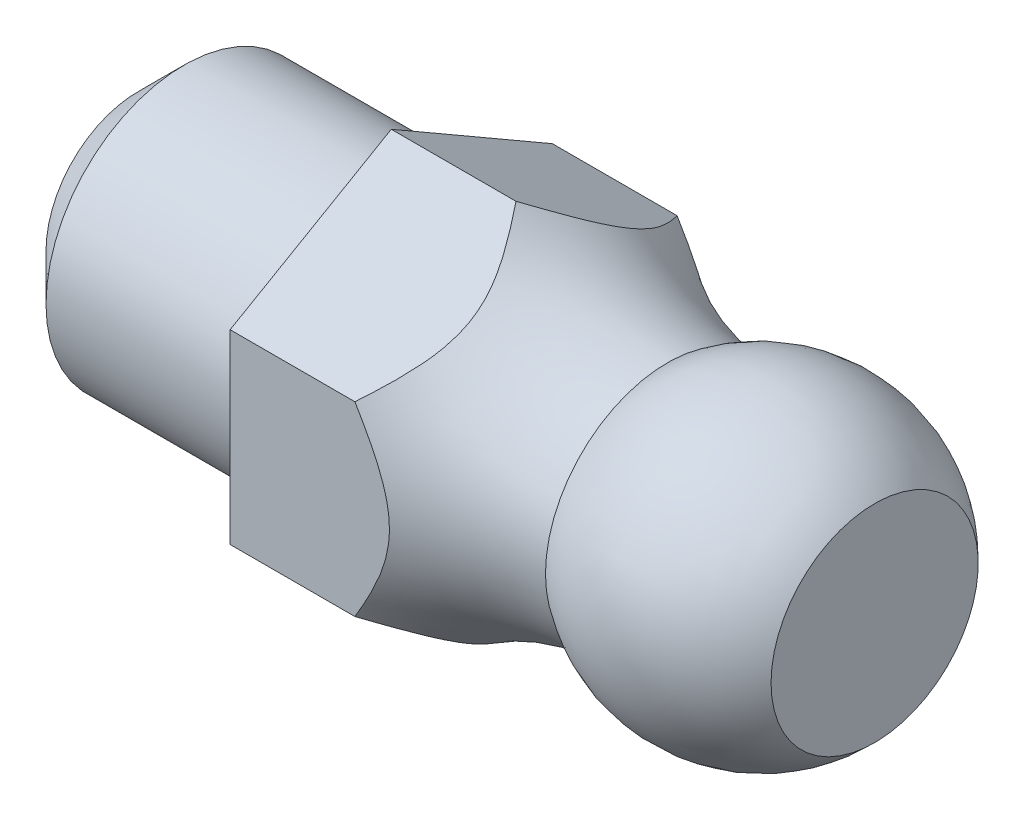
ISO-10303-21;
HEADER;
FILE_DESCRIPTION(('STEP AP214'),'2;1');
FILE_NAME('part.step','',(''),(''),'','','');
FILE_SCHEMA(('AUTOMOTIVE_DESIGN { 1 0 10303 214 1 1 1 1 }'));
ENDSEC;
DATA;
#1=APPLICATION_CONTEXT('core data for automotive mechanical design processes');
#2=APPLICATION_PROTOCOL_DEFINITION('international standard','automotive_design',2000,#1);
#3=PRODUCT_CONTEXT('',#1,'mechanical');
#4=PRODUCT('Part','Part','',(#3));
#5=PRODUCT_RELATED_PRODUCT_CATEGORY('part','',(#4));
#6=PRODUCT_DEFINITION_FORMATION('','',#4);
#7=PRODUCT_DEFINITION_CONTEXT('part definition',#1,'design');
#8=PRODUCT_DEFINITION('design','',#6,#7);
#9=PRODUCT_DEFINITION_SHAPE('','',#8);
#10=(LENGTH_UNIT() NAMED_UNIT(*) SI_UNIT(.MILLI.,.METRE.));
#11=(NAMED_UNIT(*) PLANE_ANGLE_UNIT() SI_UNIT($,.RADIAN.));
#12=(NAMED_UNIT(*) SI_UNIT($,.STERADIAN.) SOLID_ANGLE_UNIT());
#13=UNCERTAINTY_MEASURE_WITH_UNIT(LENGTH_MEASURE(1.E-05),#10,'distance_accuracy_value','');
#14=(GEOMETRIC_REPRESENTATION_CONTEXT(3) GLOBAL_UNCERTAINTY_ASSIGNED_CONTEXT((#13)) GLOBAL_UNIT_ASSIGNED_CONTEXT((#10,
#11,#12)) REPRESENTATION_CONTEXT('',''));
#15=CARTESIAN_POINT('',(0.,0.,0.));
#16=DIRECTION('',(0.,0.,1.));
#17=DIRECTION('',(1.,0.,0.));
#18=AXIS2_PLACEMENT_3D('',#15,#16,#17);
#19=CARTESIAN_POINT('',(5.5,3.,0.));
#20=DIRECTION('',(-1.,0.,0.));
#21=DIRECTION('',(0.,0.,1.));
#22=AXIS2_PLACEMENT_3D('',#19,#20,#21);
#23=PLANE('',#22);
#24=CARTESIAN_POINT('',(5.5,0.,0.));
#25=DIRECTION('',(-1.,0.,0.));
#26=DIRECTION('',(0.,0.,1.));
#27=AXIS2_PLACEMENT_3D('',#24,#25,#26);
#28=CIRCLE('',#27,3.);
#29=CARTESIAN_POINT('',(5.5,0.,3.));
#30=VERTEX_POINT('',#29);
#31=EDGE_CURVE('E150',#30,#30,#28,.T.);
#32=ORIENTED_EDGE('',*,*,#31,.F.);
#33=EDGE_LOOP('',(#32));
#34=FACE_BOUND('',#33,.T.);
#35=DIRECTION('',(0.,-0.5,0.866025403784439));
#36=VECTOR('',#35,1.);
#37=CARTESIAN_POINT('',(5.5,0.768233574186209,5.66938041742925));
#38=LINE('',#37,#36);
#39=CARTESIAN_POINT('',(5.5,4.04145188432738,0.));
#40=VERTEX_POINT('',#39);
#41=CARTESIAN_POINT('',(5.5,2.02072594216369,3.5));
#42=VERTEX_POINT('',#41);
#43=EDGE_CURVE('E91',#40,#42,#38,.T.);
#44=ORIENTED_EDGE('',*,*,#43,.F.);
#45=DIRECTION('',(0.,-0.5,-0.866025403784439));
#46=VECTOR('',#45,1.);
#47=CARTESIAN_POINT('',(5.5,0.768233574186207,-5.66938041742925));
#48=LINE('',#47,#46);
#49=CARTESIAN_POINT('',(5.5,2.02072594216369,-3.5));
#50=VERTEX_POINT('',#49);
#51=EDGE_CURVE('E49',#40,#50,#48,.T.);
#52=ORIENTED_EDGE('',*,*,#51,.T.);
#53=DIRECTION('',(0.,-1.,0.));
#54=VECTOR('',#53,1.);
#55=CARTESIAN_POINT('',(5.5,-9.05142135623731,-3.5));
#56=LINE('',#55,#54);
#57=CARTESIAN_POINT('',(5.5,-2.02072594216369,-3.5));
#58=VERTEX_POINT('',#57);
#59=EDGE_CURVE('E105',#50,#58,#56,.T.);
#60=ORIENTED_EDGE('',*,*,#59,.T.);
#61=DIRECTION('',(0.,0.5,-0.866025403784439));
#62=VECTOR('',#61,1.);
#63=CARTESIAN_POINT('',(5.5,-5.29394425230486,2.16938041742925));
#64=LINE('',#63,#62);
#65=CARTESIAN_POINT('',(5.5,-4.04145188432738,0.));
#66=VERTEX_POINT('',#65);
#67=EDGE_CURVE('E99',#66,#58,#64,.T.);
#68=ORIENTED_EDGE('',*,*,#67,.F.);
#69=DIRECTION('',(0.,0.5,0.866025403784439));
#70=VECTOR('',#69,1.);
#71=CARTESIAN_POINT('',(5.5,-5.29394425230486,-2.16938041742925));
#72=LINE('',#71,#70);
#73=CARTESIAN_POINT('',(5.5,-2.02072594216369,3.5));
#74=VERTEX_POINT('',#73);
#75=EDGE_CURVE('E97',#66,#74,#72,.T.);
#76=ORIENTED_EDGE('',*,*,#75,.T.);
#77=DIRECTION('',(0.,-1.,0.));
#78=VECTOR('',#77,1.);
#79=CARTESIAN_POINT('',(5.5,-9.05142135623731,3.5));
#80=LINE('',#79,#78);
#81=EDGE_CURVE('E82',#42,#74,#80,.T.);
#82=ORIENTED_EDGE('',*,*,#81,.F.);
#83=EDGE_LOOP('',(#44,#52,#60,#68,#76,#82));
#84=FACE_BOUND('',#83,.T.);
#85=ADVANCED_FACE('F26',(#34,#84),#23,.T.);
#86=CARTESIAN_POINT('',(-3.37556837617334,0.,0.));
#87=DIRECTION('',(-1.,0.,0.));
#88=DIRECTION('',(0.,0.,1.));
#89=AXIS2_PLACEMENT_3D('',#86,#87,#88);
#90=CYLINDRICAL_SURFACE('',#89,3.);
#91=CARTESIAN_POINT('',(1.00000000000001,0.,0.));
#92=DIRECTION('',(-1.,0.,0.));
#93=DIRECTION('',(0.,0.,1.));
#94=AXIS2_PLACEMENT_3D('',#91,#92,#93);
#95=CIRCLE('',#94,3.);
#96=CARTESIAN_POINT('',(1.00000000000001,0.,3.));
#97=VERTEX_POINT('',#96);
#98=EDGE_CURVE('E11',#97,#97,#95,.F.);
#99=ORIENTED_EDGE('',*,*,#98,.T.);
#100=EDGE_LOOP('',(#99));
#101=FACE_BOUND('',#100,.T.);
#102=ORIENTED_EDGE('',*,*,#31,.T.);
#103=EDGE_LOOP('',(#102));
#104=FACE_BOUND('',#103,.T.);
#105=ADVANCED_FACE('F174',(#101,#104),#90,.T.);
#106=CARTESIAN_POINT('',(0.,0.,0.));
#107=DIRECTION('',(-1.,0.,0.));
#108=DIRECTION('',(0.,0.,1.));
#109=AXIS2_PLACEMENT_3D('',#106,#107,#108);
#110=PLANE('',#109);
#111=CARTESIAN_POINT('',(0.,0.,0.));
#112=DIRECTION('',(-1.,0.,0.));
#113=DIRECTION('',(0.,0.,1.));
#114=AXIS2_PLACEMENT_3D('',#111,#112,#113);
#115=CIRCLE('',#114,1.99999999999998);
#116=CARTESIAN_POINT('',(0.,0.,1.99999999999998));
#117=VERTEX_POINT('',#116);
#118=EDGE_CURVE('E34',#117,#117,#115,.T.);
#119=ORIENTED_EDGE('',*,*,#118,.T.);
#120=EDGE_LOOP('',(#119));
#121=FACE_BOUND('',#120,.T.);
#122=ADVANCED_FACE('F166',(#121),#110,.T.);
#123=CARTESIAN_POINT('',(0.,0.,0.));
#124=DIRECTION('',(1.,0.,0.));
#125=DIRECTION('',(0.,0.,-1.));
#126=AXIS2_PLACEMENT_3D('',#123,#124,#125);
#127=CONICAL_SURFACE('',#126,1.99999999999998,0.785398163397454);
#128=ORIENTED_EDGE('',*,*,#98,.F.);
#129=EDGE_LOOP('',(#128));
#130=FACE_BOUND('',#129,.T.);
#131=ORIENTED_EDGE('',*,*,#118,.F.);
#132=EDGE_LOOP('',(#131));
#133=FACE_BOUND('',#132,.T.);
#134=ADVANCED_FACE('F140',(#130,#133),#127,.T.);
#135=CARTESIAN_POINT('',(16.,0.768233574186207,-5.66938041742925));
#136=DIRECTION('',(0.,0.866025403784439,-0.5));
#137=DIRECTION('',(0.,0.5,0.866025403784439));
#138=AXIS2_PLACEMENT_3D('',#135,#136,#137);
#139=PLANE('',#138);
#140=DIRECTION('',(-1.,0.,0.));
#141=VECTOR('',#140,1.);
#142=CARTESIAN_POINT('',(16.,2.02072594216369,-3.5));
#143=LINE('',#142,#141);
#144=CARTESIAN_POINT('',(8.21007723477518,2.02072594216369,-3.5));
#145=VERTEX_POINT('',#144);
#146=EDGE_CURVE('E108',#145,#50,#143,.T.);
#147=ORIENTED_EDGE('',*,*,#146,.T.);
#148=ORIENTED_EDGE('',*,*,#51,.F.);
#149=DIRECTION('',(-1.,0.,0.));
#150=VECTOR('',#149,1.);
#151=CARTESIAN_POINT('',(16.,4.04145188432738,0.));
#152=LINE('',#151,#150);
#153=CARTESIAN_POINT('',(8.21007723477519,4.04145188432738,0.));
#154=VERTEX_POINT('',#153);
#155=EDGE_CURVE('E88',#154,#40,#152,.T.);
#156=ORIENTED_EDGE('',*,*,#155,.F.);
#157=CARTESIAN_POINT('',(8.20994080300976,2.02061047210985,-3.5002));
#158=CARTESIAN_POINT('',(8.2613234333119,2.06415539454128,-3.42477798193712));
#159=CARTESIAN_POINT('',(8.31226983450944,2.1078440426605,-3.34910702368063));
#160=CARTESIAN_POINT('',(8.41220767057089,2.19592012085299,-3.19655478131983));
#161=CARTESIAN_POINT('',(8.46119382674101,2.24030904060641,-3.11967091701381));
#162=CARTESIAN_POINT('',(8.55755501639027,2.3315887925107,-2.96156974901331));
#163=CARTESIAN_POINT('',(8.60480910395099,2.37851223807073,-2.88029595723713));
#164=CARTESIAN_POINT('',(8.69374174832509,2.47361044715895,-2.71558102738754));
#165=CARTESIAN_POINT('',(8.73542568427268,2.52178394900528,-2.63214207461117));
#166=CARTESIAN_POINT('',(8.82307185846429,2.63592818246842,-2.43443846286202));
#167=CARTESIAN_POINT('',(8.86592992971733,2.70253996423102,-2.3190634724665));
#168=CARTESIAN_POINT('',(8.91354899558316,2.80391739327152,-2.14347261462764));
#169=CARTESIAN_POINT('',(8.92660898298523,2.83770919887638,-2.08494349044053));
#170=CARTESIAN_POINT('',(8.94661340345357,2.90574836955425,-1.96709618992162));
#171=CARTESIAN_POINT('',(8.95355887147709,2.9399956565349,-1.90777814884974));
#172=CARTESIAN_POINT('',(8.96087276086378,3.00895821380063,-1.78833149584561));
#173=CARTESIAN_POINT('',(8.96118529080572,3.04367499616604,-1.72820026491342));
#174=CARTESIAN_POINT('',(8.95506778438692,3.11295975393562,-1.60819554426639));
#175=CARTESIAN_POINT('',(8.94863707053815,3.14752771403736,-1.54832208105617));
#176=CARTESIAN_POINT('',(8.92935118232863,3.2167427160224,-1.4284381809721));
#177=CARTESIAN_POINT('',(8.91639936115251,3.25138289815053,-1.36843962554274));
#178=CARTESIAN_POINT('',(8.88486636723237,3.32000171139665,-1.24958835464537));
#179=CARTESIAN_POINT('',(8.86628535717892,3.35398036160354,-1.19073560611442));
#180=CARTESIAN_POINT('',(8.80863656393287,3.44667049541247,-1.030191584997));
#181=CARTESIAN_POINT('',(8.76471163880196,3.50462102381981,-0.929818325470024));
#182=CARTESIAN_POINT('',(8.66735891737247,3.61856391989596,-0.732463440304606));
#183=CARTESIAN_POINT('',(8.61390851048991,3.67455124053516,-0.635490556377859));
#184=CARTESIAN_POINT('',(8.50335306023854,3.78295211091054,-0.447734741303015));
#185=CARTESIAN_POINT('',(8.44646108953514,3.83542087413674,-0.35685617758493));
#186=CARTESIAN_POINT('',(8.35897119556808,3.91331855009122,-0.221933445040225));
#187=CARTESIAN_POINT('',(8.32953438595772,3.93907939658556,-0.177314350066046));
#188=CARTESIAN_POINT('',(8.27010528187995,3.99043365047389,-0.0883661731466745));
#189=CARTESIAN_POINT('',(8.24011310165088,4.01602709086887,-0.0440370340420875));
#190=CARTESIAN_POINT('',(8.20994080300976,4.04156735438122,0.000199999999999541));
#191=B_SPLINE_CURVE_WITH_KNOTS('',3,(#157,#158,#159,#160,#161,#162,#163,#164,#165,#166,#167,
#168,#169,#170,#171,#172,#173,#174,#175,#176,#177,#178,#179,#180,#181,#182,#183,#184,#185,#186,
#187,#188,#189,#190),.UNSPECIFIED.,.F.,.F.,(4,2,2,2,2,2,2,2,2,2,2,2,2,2,2,2,4),(0.,
0.303390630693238,0.607549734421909,0.922626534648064,1.23739682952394,1.65572407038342,
1.86199057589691,2.06822216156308,2.27619084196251,2.48418041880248,2.69534749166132,
2.90650846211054,3.27761529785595,3.64961505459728,4.00762314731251,4.18563606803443,
4.36361276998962),.UNSPECIFIED.);
#192=EDGE_CURVE('E143',#145,#154,#191,.T.);
#193=ORIENTED_EDGE('',*,*,#192,.F.);
#194=EDGE_LOOP('',(#147,#148,#156,#193));
#195=FACE_BOUND('',#194,.T.);
#196=ADVANCED_FACE('F135',(#195),#139,.T.);
#197=CARTESIAN_POINT('',(16.,-9.05142135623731,-3.5));
#198=DIRECTION('',(0.,0.,-1.));
#199=DIRECTION('',(-1.,0.,0.));
#200=AXIS2_PLACEMENT_3D('',#197,#198,#199);
#201=PLANE('',#200);
#202=DIRECTION('',(-1.,0.,0.));
#203=VECTOR('',#202,1.);
#204=CARTESIAN_POINT('',(16.,-2.02072594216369,-3.5));
#205=LINE('',#204,#203);
#206=CARTESIAN_POINT('',(8.21007723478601,-2.02072594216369,-3.5));
#207=VERTEX_POINT('',#206);
#208=EDGE_CURVE('E111',#207,#58,#205,.T.);
#209=ORIENTED_EDGE('',*,*,#208,.T.);
#210=ORIENTED_EDGE('',*,*,#59,.F.);
#211=ORIENTED_EDGE('',*,*,#146,.F.);
#212=CARTESIAN_POINT('',(8.96021328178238,0.,-3.5));
#213=CARTESIAN_POINT('',(8.9602081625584,0.0787167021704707,-3.5));
#214=CARTESIAN_POINT('',(8.95582313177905,0.157471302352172,-3.5));
#215=CARTESIAN_POINT('',(8.93868479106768,0.314097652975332,-3.5));
#216=CARTESIAN_POINT('',(8.92592318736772,0.391968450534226,-3.5));
#217=CARTESIAN_POINT('',(8.89299650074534,0.546702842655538,-3.5));
#218=CARTESIAN_POINT('',(8.87277702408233,0.62355462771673,-3.5));
#219=CARTESIAN_POINT('',(8.82634596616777,0.775347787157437,-3.5));
#220=CARTESIAN_POINT('',(8.80013710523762,0.850290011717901,-3.5));
#221=CARTESIAN_POINT('',(8.71859641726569,1.06199406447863,-3.5));
#222=CARTESIAN_POINT('',(8.65759121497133,1.19654268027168,-3.5));
#223=CARTESIAN_POINT('',(8.5264738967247,1.46118280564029,-3.5));
#224=CARTESIAN_POINT('',(8.45634684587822,1.59126655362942,-3.5));
#225=CARTESIAN_POINT('',(8.31114581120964,1.84940452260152,-3.5));
#226=CARTESIAN_POINT('',(8.23605037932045,1.97744652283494,-3.5));
#227=CARTESIAN_POINT('',(8.08419910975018,2.23240202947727,-3.5));
#228=CARTESIAN_POINT('',(8.00744446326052,2.35931625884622,-3.5));
#229=CARTESIAN_POINT('',(7.85384849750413,2.61395422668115,-3.5));
#230=CARTESIAN_POINT('',(7.77700863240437,2.74167886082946,-3.5));
#231=CARTESIAN_POINT('',(7.6251067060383,2.99821545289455,-3.5));
#232=CARTESIAN_POINT('',(7.55004492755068,3.12702757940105,-3.5));
#233=CARTESIAN_POINT('',(7.40305922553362,3.38602580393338,-3.5));
#234=CARTESIAN_POINT('',(7.33112807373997,3.51620776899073,-3.5));
#235=CARTESIAN_POINT('',(7.19117244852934,3.77864475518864,-3.5));
#236=CARTESIAN_POINT('',(7.12314768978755,3.91089962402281,-3.5));
#237=CARTESIAN_POINT('',(6.94696503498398,4.26893452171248,-3.5));
#238=CARTESIAN_POINT('',(6.84313704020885,4.49688353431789,-3.5));
#239=CARTESIAN_POINT('',(6.65222287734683,4.95991479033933,-3.5));
#240=CARTESIAN_POINT('',(6.5651469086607,5.19500127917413,-3.5));
#241=CARTESIAN_POINT('',(6.4106267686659,5.67178118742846,-3.5));
#242=CARTESIAN_POINT('',(6.34319627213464,5.91347908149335,-3.5));
#243=CARTESIAN_POINT('',(6.23054610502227,6.40198194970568,-3.5));
#244=CARTESIAN_POINT('',(6.18531834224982,6.64878502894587,-3.5));
#245=CARTESIAN_POINT('',(6.12621201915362,7.09223741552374,-3.5));
#246=CARTESIAN_POINT('',(6.10768662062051,7.28827345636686,-3.5));
#247=CARTESIAN_POINT('',(6.08637625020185,7.68118825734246,-3.5));
#248=CARTESIAN_POINT('',(6.08358819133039,7.8780668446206,-3.5));
#249=CARTESIAN_POINT('',(6.09437261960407,8.27111977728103,-3.5));
#250=CARTESIAN_POINT('',(6.10792279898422,8.46729471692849,-3.5));
#251=CARTESIAN_POINT('',(6.15178419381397,8.85778082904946,-3.5));
#252=CARTESIAN_POINT('',(6.18209574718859,9.05209196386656,-3.5));
#253=CARTESIAN_POINT('',(6.25991933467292,9.43830277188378,-3.5));
#254=CARTESIAN_POINT('',(6.30751983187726,9.63018469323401,-3.5));
#255=CARTESIAN_POINT('',(6.41992420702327,10.0088586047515,-3.5));
#256=CARTESIAN_POINT('',(6.48472842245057,10.1956504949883,-3.5));
#257=CARTESIAN_POINT('',(6.63137767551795,10.5625324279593,-3.5));
#258=CARTESIAN_POINT('',(6.7132306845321,10.7426192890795,-3.5));
#259=CARTESIAN_POINT('',(6.89353603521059,11.0942802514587,-3.5));
#260=CARTESIAN_POINT('',(6.99198692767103,11.2658550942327,-3.5));
#261=CARTESIAN_POINT('',(7.19572015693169,11.5845438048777,-3.5));
#262=CARTESIAN_POINT('',(7.29969605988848,11.7324942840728,-3.5));
#263=CARTESIAN_POINT('',(7.52032938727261,12.0186158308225,-3.5));
#264=CARTESIAN_POINT('',(7.63698606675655,12.1567874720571,-3.5));
#265=CARTESIAN_POINT('',(7.88212137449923,12.4220856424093,-3.5));
#266=CARTESIAN_POINT('',(8.01059397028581,12.5492177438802,-3.5));
#267=CARTESIAN_POINT('',(8.27847477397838,12.7913876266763,-3.5));
#268=CARTESIAN_POINT('',(8.41788261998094,12.9064258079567,-3.5));
#269=CARTESIAN_POINT('',(8.6986176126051,13.1173987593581,-3.5));
#270=CARTESIAN_POINT('',(8.83941718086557,13.2140363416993,-3.5));
#271=CARTESIAN_POINT('',(9.12888463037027,13.3948316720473,-3.5));
#272=CARTESIAN_POINT('',(9.27755513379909,13.4789852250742,-3.5));
#273=CARTESIAN_POINT('',(9.5815676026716,13.6340396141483,-3.5));
#274=CARTESIAN_POINT('',(9.73690645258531,13.7049465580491,-3.5));
#275=CARTESIAN_POINT('',(10.0532288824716,13.8329890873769,-3.5));
#276=CARTESIAN_POINT('',(10.2142144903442,13.890119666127,-3.5));
#277=CARTESIAN_POINT('',(10.535984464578,13.9886936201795,-3.5));
#278=CARTESIAN_POINT('',(10.6966480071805,14.0305317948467,-3.5));
#279=CARTESIAN_POINT('',(11.021014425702,14.1003929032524,-3.5));
#280=CARTESIAN_POINT('',(11.1847183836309,14.1284108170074,-3.5));
#281=CARTESIAN_POINT('',(11.5138439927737,14.1703738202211,-3.5));
#282=CARTESIAN_POINT('',(11.6792648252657,14.184325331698,-3.5));
#283=CARTESIAN_POINT('',(12.0107554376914,14.1980686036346,-3.5));
#284=CARTESIAN_POINT('',(12.1768254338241,14.1978551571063,-3.5));
#285=CARTESIAN_POINT('',(12.5063921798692,14.1833433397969,-3.5));
#286=CARTESIAN_POINT('',(12.6698962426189,14.1692104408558,-3.5));
#287=CARTESIAN_POINT('',(12.9951920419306,14.1272081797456,-3.5));
#288=CARTESIAN_POINT('',(13.1569831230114,14.0993337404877,-3.5));
#289=CARTESIAN_POINT('',(13.4775740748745,14.0300793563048,-3.5));
#290=CARTESIAN_POINT('',(13.636375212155,13.988705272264,-3.5));
#291=CARTESIAN_POINT('',(13.9500128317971,13.8927493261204,-3.5));
#292=CARTESIAN_POINT('',(14.1048474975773,13.8381615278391,-3.5));
#293=CARTESIAN_POINT('',(14.409556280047,13.7161491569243,-3.5));
#294=CARTESIAN_POINT('',(14.5594251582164,13.6487115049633,-3.5));
#295=CARTESIAN_POINT('',(14.8529418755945,13.5015889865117,-3.5));
#296=CARTESIAN_POINT('',(14.9965924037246,13.4219094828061,-3.5));
#297=CARTESIAN_POINT('',(15.2768311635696,13.25085704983,-3.5));
#298=CARTESIAN_POINT('',(15.4134165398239,13.1594794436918,-3.5));
#299=CARTESIAN_POINT('',(15.6785188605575,12.9657822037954,-3.5));
#300=CARTESIAN_POINT('',(15.8070385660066,12.8634663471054,-3.5));
#301=CARTESIAN_POINT('',(16.0569373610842,12.6471646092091,-3.5));
#302=CARTESIAN_POINT('',(16.1781951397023,12.533038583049,-3.5));
#303=CARTESIAN_POINT('',(16.410832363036,12.2952061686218,-3.5));
#304=CARTESIAN_POINT('',(16.5222150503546,12.1715029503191,-3.5));
#305=CARTESIAN_POINT('',(16.7345268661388,11.9153509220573,-3.5));
#306=CARTESIAN_POINT('',(16.8354518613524,11.782898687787,-3.5));
#307=CARTESIAN_POINT('',(17.0262075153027,11.5103010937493,-3.5));
#308=CARTESIAN_POINT('',(17.1160416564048,11.3701581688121,-3.5));
#309=CARTESIAN_POINT('',(17.2866367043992,11.078978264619,-3.5));
#310=CARTESIAN_POINT('',(17.3670598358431,10.9277433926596,-3.5));
#311=CARTESIAN_POINT('',(17.5153294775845,10.6192923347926,-3.5));
#312=CARTESIAN_POINT('',(17.5831797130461,10.4620779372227,-3.5));
#313=CARTESIAN_POINT('',(17.706110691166,10.1426823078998,-3.5));
#314=CARTESIAN_POINT('',(17.7611874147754,9.980499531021,-3.5));
#315=CARTESIAN_POINT('',(17.858413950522,9.65236011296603,-3.5));
#316=CARTESIAN_POINT('',(17.9005671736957,9.48640448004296,-3.5));
#317=CARTESIAN_POINT('',(17.9738237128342,9.14307896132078,-3.5));
#318=CARTESIAN_POINT('',(18.0042420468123,8.96556292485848,-3.5));
#319=CARTESIAN_POINT('',(18.0509625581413,8.60869023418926,-3.5));
#320=CARTESIAN_POINT('',(18.0672643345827,8.42933352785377,-3.5));
#321=CARTESIAN_POINT('',(18.0860519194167,8.06985388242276,-3.5));
#322=CARTESIAN_POINT('',(18.0885336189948,7.88973073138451,-3.5));
#323=CARTESIAN_POINT('',(18.0801052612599,7.52979598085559,-3.5));
#324=CARTESIAN_POINT('',(18.0691939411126,7.34998441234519,-3.5));
#325=CARTESIAN_POINT('',(18.0329064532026,6.97473710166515,-3.5));
#326=CARTESIAN_POINT('',(18.0062654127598,6.77942383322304,-3.5));
#327=CARTESIAN_POINT('',(17.9385209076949,6.39133514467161,-3.5));
#328=CARTESIAN_POINT('',(17.8974165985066,6.19855987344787,-3.5));
#329=CARTESIAN_POINT('',(17.8018378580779,5.81649567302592,-3.5));
#330=CARTESIAN_POINT('',(17.7473714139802,5.62720473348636,-3.5));
#331=CARTESIAN_POINT('',(17.626275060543,5.25258073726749,-3.5));
#332=CARTESIAN_POINT('',(17.5596450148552,5.06724772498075,-3.5));
#333=CARTESIAN_POINT('',(17.40238977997,4.6672952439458,-3.5));
#334=CARTESIAN_POINT('',(17.3096049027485,4.45352776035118,-3.5));
#335=CARTESIAN_POINT('',(17.1114867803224,4.03187332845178,-3.5));
#336=CARTESIAN_POINT('',(17.0061494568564,3.82398831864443,-3.5));
#337=CARTESIAN_POINT('',(16.7858713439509,3.41309017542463,-3.5));
#338=CARTESIAN_POINT('',(16.6709184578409,3.21008360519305,-3.5));
#339=CARTESIAN_POINT('',(16.4943586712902,2.90803199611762,-3.5));
#340=CARTESIAN_POINT('',(16.4348169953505,2.80775782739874,-3.5));
#341=CARTESIAN_POINT('',(16.3150046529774,2.60764494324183,-3.5));
#342=CARTESIAN_POINT('',(16.2547339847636,2.50780622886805,-3.5));
#343=CARTESIAN_POINT('',(16.1298057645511,2.30074525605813,-3.5));
#344=CARTESIAN_POINT('',(16.06515204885,2.19352076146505,-3.5));
#345=CARTESIAN_POINT('',(15.9371718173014,1.97828621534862,-3.5));
#346=CARTESIAN_POINT('',(15.8738451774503,1.87027623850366,-3.5));
#347=CARTESIAN_POINT('',(15.7502089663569,1.65240369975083,-3.5));
#348=CARTESIAN_POINT('',(15.6899020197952,1.5425396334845,-3.5));
#349=CARTESIAN_POINT('',(15.5748859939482,1.31990829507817,-3.5));
#350=CARTESIAN_POINT('',(15.5201739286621,1.20714261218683,-3.5));
#351=CARTESIAN_POINT('',(15.4409706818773,1.02555738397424,-3.5));
#352=CARTESIAN_POINT('',(15.4134115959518,0.958087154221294,-3.5));
#353=CARTESIAN_POINT('',(15.3623743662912,0.821589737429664,-3.5));
#354=CARTESIAN_POINT('',(15.3388967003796,0.752562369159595,-3.5));
#355=CARTESIAN_POINT('',(15.2972005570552,0.613336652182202,-3.5));
#356=CARTESIAN_POINT('',(15.2789531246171,0.543147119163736,-3.5));
#357=CARTESIAN_POINT('',(15.2486092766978,0.401472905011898,-3.5));
#358=CARTESIAN_POINT('',(15.2365088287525,0.32998910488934,-3.5));
#359=CARTESIAN_POINT('',(15.21916192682,0.184984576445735,-3.5));
#360=CARTESIAN_POINT('',(15.2140310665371,0.11144966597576,-3.5));
#361=CARTESIAN_POINT('',(15.2114242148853,-0.035760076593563,-3.5));
#362=CARTESIAN_POINT('',(15.2139483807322,-0.109434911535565,-3.5));
#363=CARTESIAN_POINT('',(15.2264592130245,-0.256389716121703,-3.5));
#364=CARTESIAN_POINT('',(15.2364715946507,-0.329667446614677,-3.5));
#365=CARTESIAN_POINT('',(15.2632016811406,-0.474935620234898,-3.5));
#366=CARTESIAN_POINT('',(15.279917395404,-0.546926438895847,-3.5));
#367=CARTESIAN_POINT('',(15.3284605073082,-0.723925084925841,-3.5));
#368=CARTESIAN_POINT('',(15.3636845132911,-0.827992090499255,-3.5));
#369=CARTESIAN_POINT('',(15.4429476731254,-1.0327324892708,-3.5));
#370=CARTESIAN_POINT('',(15.4869979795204,-1.1334013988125,-3.5));
#371=CARTESIAN_POINT('',(15.581193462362,-1.33248097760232,-3.5));
#372=CARTESIAN_POINT('',(15.6313711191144,-1.43087600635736,-3.5));
#373=CARTESIAN_POINT('',(15.7354014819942,-1.62560534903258,-3.5));
#374=CARTESIAN_POINT('',(15.7892522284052,-1.72194072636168,-3.5));
#375=CARTESIAN_POINT('',(15.900086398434,-1.91514038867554,-3.5));
#376=CARTESIAN_POINT('',(15.9571092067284,-2.01198185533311,-3.5));
#377=CARTESIAN_POINT('',(16.0721488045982,-2.20507876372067,-3.5));
#378=CARTESIAN_POINT('',(16.1301656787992,-2.30133415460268,-3.5));
#379=CARTESIAN_POINT('',(16.2461023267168,-2.49350644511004,-3.5));
#380=CARTESIAN_POINT('',(16.3040218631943,-2.58942348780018,-3.5));
#381=CARTESIAN_POINT('',(16.4192337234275,-2.78163284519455,-3.5));
#382=CARTESIAN_POINT('',(16.476526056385,-2.87792515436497,-3.5));
#383=CARTESIAN_POINT('',(16.6083961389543,-3.10273641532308,-3.5));
#384=CARTESIAN_POINT('',(16.682518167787,-3.23152469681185,-3.5));
#385=CARTESIAN_POINT('',(16.8275485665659,-3.49090646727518,-3.5));
#386=CARTESIAN_POINT('',(16.8984569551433,-3.62149994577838,-3.5));
#387=CARTESIAN_POINT('',(17.0362091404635,-3.88497416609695,-3.5));
#388=CARTESIAN_POINT('',(17.1030492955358,-4.01785682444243,-3.5));
#389=CARTESIAN_POINT('',(17.2317985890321,-4.28598865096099,-3.5));
#390=CARTESIAN_POINT('',(17.2937076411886,-4.42123786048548,-3.5));
#391=CARTESIAN_POINT('',(17.4699151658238,-4.82828460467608,-3.5));
#392=CARTESIAN_POINT('',(17.5759585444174,-5.10374644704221,-3.5));
#393=CARTESIAN_POINT('',(17.7609346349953,-5.6635864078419,-3.5));
#394=CARTESIAN_POINT('',(17.8398837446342,-5.94795901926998,-3.5));
#395=CARTESIAN_POINT('',(17.9466696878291,-6.43233838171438,-3.5));
#396=CARTESIAN_POINT('',(17.9827752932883,-6.63053962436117,-3.5));
#397=CARTESIAN_POINT('',(18.0394614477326,-7.02913273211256,-3.5));
#398=CARTESIAN_POINT('',(18.0600460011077,-7.22952401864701,-3.5));
#399=CARTESIAN_POINT('',(18.0848254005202,-7.63157865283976,-3.5));
#400=CARTESIAN_POINT('',(18.0890002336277,-7.83324325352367,-3.5));
#401=CARTESIAN_POINT('',(18.0802125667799,-8.23622157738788,-3.5));
#402=CARTESIAN_POINT('',(18.0672496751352,-8.43753529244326,-3.5));
#403=CARTESIAN_POINT('',(18.0235875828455,-8.83929722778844,-3.5));
#404=CARTESIAN_POINT('',(17.9927972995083,-9.03973563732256,-3.5));
#405=CARTESIAN_POINT('',(17.9131435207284,-9.43700821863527,-3.5));
#406=CARTESIAN_POINT('',(17.8642796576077,-9.63384231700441,-3.5));
#407=CARTESIAN_POINT('',(17.7484638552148,-10.0220842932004,-3.5));
#408=CARTESIAN_POINT('',(17.681515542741,-10.2134932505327,-3.5));
#409=CARTESIAN_POINT('',(17.5297461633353,-10.589088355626,-3.5));
#410=CARTESIAN_POINT('',(17.4449267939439,-10.7732751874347,-3.5));
#411=CARTESIAN_POINT('',(17.2662311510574,-11.1165631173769,-3.5));
#412=CARTESIAN_POINT('',(17.1738362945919,-11.2764367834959,-3.5));
#413=CARTESIAN_POINT('',(16.9751428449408,-11.5872977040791,-3.5));
#414=CARTESIAN_POINT('',(16.8688451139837,-11.7382855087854,-3.5));
#415=CARTESIAN_POINT('',(16.6430839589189,-12.0299851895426,-3.5));
#416=CARTESIAN_POINT('',(16.5236256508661,-12.1707010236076,-3.5));
#417=CARTESIAN_POINT('',(16.2723644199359,-12.4406441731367,-3.5));
#418=CARTESIAN_POINT('',(16.1405620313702,-12.5698719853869,-3.5));
#419=CARTESIAN_POINT('',(15.8745321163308,-12.8076790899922,-3.5));
#420=CARTESIAN_POINT('',(15.7410145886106,-12.9170536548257,-3.5));
#421=CARTESIAN_POINT('',(15.4649996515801,-13.1238098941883,-3.5));
#422=CARTESIAN_POINT('',(15.3225027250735,-13.2211922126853,-3.5));
#423=CARTESIAN_POINT('',(15.0295769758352,-13.4031414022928,-3.5));
#424=CARTESIAN_POINT('',(14.8791493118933,-13.4877101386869,-3.5));
#425=CARTESIAN_POINT('',(14.57145827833,-13.6433359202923,-3.5));
#426=CARTESIAN_POINT('',(14.4141950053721,-13.7143931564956,-3.5));
#427=CARTESIAN_POINT('',(14.0993172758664,-13.8402759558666,-3.5));
#428=CARTESIAN_POINT('',(13.9418859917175,-13.895560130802,-3.5));
#429=CARTESIAN_POINT('',(13.6228218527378,-13.9925046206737,-3.5));
#430=CARTESIAN_POINT('',(13.4611875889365,-14.0341603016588,-3.5));
#431=CARTESIAN_POINT('',(13.1350213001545,-14.1034692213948,-3.5));
#432=CARTESIAN_POINT('',(12.9704906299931,-14.1311288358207,-3.5));
#433=CARTESIAN_POINT('',(12.6396025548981,-14.1722581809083,-3.5));
#434=CARTESIAN_POINT('',(12.4732445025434,-14.1857227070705,-3.5));
#435=CARTESIAN_POINT('',(12.1425096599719,-14.1982394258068,-3.5));
#436=CARTESIAN_POINT('',(11.9781409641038,-14.1975065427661,-3.5));
#437=CARTESIAN_POINT('',(11.649992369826,-14.1821571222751,-3.5));
#438=CARTESIAN_POINT('',(11.486212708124,-14.1675355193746,-3.5));
#439=CARTESIAN_POINT('',(11.1605395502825,-14.1245250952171,-3.5));
#440=CARTESIAN_POINT('',(10.9986453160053,-14.0961418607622,-3.5));
#441=CARTESIAN_POINT('',(10.6777650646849,-14.0258202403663,-3.5));
#442=CARTESIAN_POINT('',(10.518780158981,-13.9838767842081,-3.5));
#443=CARTESIAN_POINT('',(10.20525558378,-13.8868752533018,-3.5));
#444=CARTESIAN_POINT('',(10.0507067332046,-13.8318468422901,-3.5));
#445=CARTESIAN_POINT('',(9.74668865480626,-13.7090247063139,-3.5));
#446=CARTESIAN_POINT('',(9.59722172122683,-13.6412253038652,-3.5));
#447=CARTESIAN_POINT('',(9.30446411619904,-13.4933996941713,-3.5));
#448=CARTESIAN_POINT('',(9.16117342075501,-13.4133735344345,-3.5));
#449=CARTESIAN_POINT('',(8.88179034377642,-13.2417425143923,-3.5));
#450=CARTESIAN_POINT('',(8.74569490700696,-13.1501426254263,-3.5));
#451=CARTESIAN_POINT('',(8.48012724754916,-12.9549998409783,-3.5));
#452=CARTESIAN_POINT('',(8.35074039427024,-12.8513407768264,-3.5));
#453=CARTESIAN_POINT('',(8.10104130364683,-12.6337022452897,-3.5));
#454=CARTESIAN_POINT('',(7.98072598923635,-12.5197263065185,-3.5));
#455=CARTESIAN_POINT('',(7.74982383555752,-12.2822321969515,-3.5));
#456=CARTESIAN_POINT('',(7.6392406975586,-12.1587104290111,-3.5));
#457=CARTESIAN_POINT('',(7.42854010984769,-11.9031145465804,-3.5));
#458=CARTESIAN_POINT('',(7.32841930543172,-11.7710431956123,-3.5));
#459=CARTESIAN_POINT('',(7.13680579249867,-11.4958952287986,-3.5));
#460=CARTESIAN_POINT('',(7.04558811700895,-11.3526270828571,-3.5));
#461=CARTESIAN_POINT('',(6.8751786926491,-11.0591743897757,-3.5));
#462=CARTESIAN_POINT('',(6.79598327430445,-10.9089919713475,-3.5));
#463=CARTESIAN_POINT('',(6.64991220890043,-10.6026903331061,-3.5));
#464=CARTESIAN_POINT('',(6.58304094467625,-10.446569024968,-3.5));
#465=CARTESIAN_POINT('',(6.46190279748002,-10.1295677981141,-3.5));
#466=CARTESIAN_POINT('',(6.40763247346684,-9.96868919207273,-3.5));
#467=CARTESIAN_POINT('',(6.30962031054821,-9.63585497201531,-3.5));
#468=CARTESIAN_POINT('',(6.26646371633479,-9.46372701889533,-3.5));
#469=CARTESIAN_POINT('',(6.1939993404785,-9.11658692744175,-3.5));
#470=CARTESIAN_POINT('',(6.16469188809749,-8.9415747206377,-3.5));
#471=CARTESIAN_POINT('',(6.11976752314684,-8.5897759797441,-3.5));
#472=CARTESIAN_POINT('',(6.10415323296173,-8.41298911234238,-3.5));
#473=CARTESIAN_POINT('',(6.08633388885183,-8.05873775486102,-3.5));
#474=CARTESIAN_POINT('',(6.08413005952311,-7.88127320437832,-3.5));
#475=CARTESIAN_POINT('',(6.09306653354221,-7.51229968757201,-3.5));
#476=CARTESIAN_POINT('',(6.10530203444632,-7.32081732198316,-3.5));
#477=CARTESIAN_POINT('',(6.14427435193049,-6.93934668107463,-3.5));
#478=CARTESIAN_POINT('',(6.17101179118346,-6.74935847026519,-3.5));
#479=CARTESIAN_POINT('',(6.23813079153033,-6.37192389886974,-3.5));
#480=CARTESIAN_POINT('',(6.27850535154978,-6.18447628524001,-3.5));
#481=CARTESIAN_POINT('',(6.37192031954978,-5.81275717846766,-3.5));
#482=CARTESIAN_POINT('',(6.42496290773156,-5.62848623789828,-3.5));
#483=CARTESIAN_POINT('',(6.56056029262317,-5.20800072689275,-3.5));
#484=CARTESIAN_POINT('',(6.64718151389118,-4.97309601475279,-3.5));
#485=CARTESIAN_POINT('',(6.83725971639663,-4.51023744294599,-3.5));
#486=CARTESIAN_POINT('',(6.94072018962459,-4.2822850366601,-3.5));
#487=CARTESIAN_POINT('',(7.16139079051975,-3.83255963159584,-3.5));
#488=CARTESIAN_POINT('',(7.27863193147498,-3.61080201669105,-3.5));
#489=CARTESIAN_POINT('',(7.46152547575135,-3.28216415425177,-3.5));
#490=CARTESIAN_POINT('',(7.52366007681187,-3.1732876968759,-3.5));
#491=CARTESIAN_POINT('',(7.64962735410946,-2.95651962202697,-3.5));
#492=CARTESIAN_POINT('',(7.71346004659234,-2.84862801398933,-3.5));
#493=CARTESIAN_POINT('',(7.85956567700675,-2.60413701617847,-3.5));
#494=CARTESIAN_POINT('',(7.94213061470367,-2.46771347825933,-3.5));
#495=CARTESIAN_POINT('',(8.10675076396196,-2.19456749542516,-3.5));
#496=CARTESIAN_POINT('',(8.18880599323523,-2.05784506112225,-3.5));
#497=CARTESIAN_POINT('',(8.34941641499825,-1.78253473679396,-3.5));
#498=CARTESIAN_POINT('',(8.42797588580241,-1.64394941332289,-3.5));
#499=CARTESIAN_POINT('',(8.53977805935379,-1.43291632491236,-3.5));
#500=CARTESIAN_POINT('',(8.57602220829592,-1.36208330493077,-3.5));
#501=CARTESIAN_POINT('',(8.64566927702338,-1.21904055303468,-3.5));
#502=CARTESIAN_POINT('',(8.67907175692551,-1.14683061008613,-3.5));
#503=CARTESIAN_POINT('',(8.77141863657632,-0.932550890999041,-3.5));
#504=CARTESIAN_POINT('',(8.82518214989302,-0.78804525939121,-3.5));
#505=CARTESIAN_POINT('',(8.8878620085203,-0.566500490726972,-3.5));
#506=CARTESIAN_POINT('',(8.90574318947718,-0.492007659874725,-3.5));
#507=CARTESIAN_POINT('',(8.93435016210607,-0.341681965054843,-3.5));
#508=CARTESIAN_POINT('',(8.94508312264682,-0.265850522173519,-3.5));
#509=CARTESIAN_POINT('',(8.95460138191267,-0.158148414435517,-3.5));
#510=CARTESIAN_POINT('',(8.9567024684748,-0.126548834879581,-3.5));
#511=CARTESIAN_POINT('',(8.95950915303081,-0.0633015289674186,-3.5));
#512=CARTESIAN_POINT('',(8.96021534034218,-0.031653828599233,-3.5));
#513=CARTESIAN_POINT('',(8.96021328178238,0.,-3.5));
#514=B_SPLINE_CURVE_WITH_KNOTS('',3,(#212,#213,#214,#215,#216,#217,#218,#219,#220,#221,#222,
#223,#224,#225,#226,#227,#228,#229,#230,#231,#232,#233,#234,#235,#236,#237,#238,#239,#240,#241,
#242,#243,#244,#245,#246,#247,#248,#249,#250,#251,#252,#253,#254,#255,#256,#257,#258,#259,#260,
#261,#262,#263,#264,#265,#266,#267,#268,#269,#270,#271,#272,#273,#274,#275,#276,#277,#278,#279,
#280,#281,#282,#283,#284,#285,#286,#287,#288,#289,#290,#291,#292,#293,#294,#295,#296,#297,#298,
#299,#300,#301,#302,#303,#304,#305,#306,#307,#308,#309,#310,#311,#312,#313,#314,#315,#316,#317,
#318,#319,#320,#321,#322,#323,#324,#325,#326,#327,#328,#329,#330,#331,#332,#333,#334,#335,#336,
#337,#338,#339,#340,#341,#342,#343,#344,#345,#346,#347,#348,#349,#350,#351,#352,#353,#354,#355,
#356,#357,#358,#359,#360,#361,#362,#363,#364,#365,#366,#367,#368,#369,#370,#371,#372,#373,#374,
#375,#376,#377,#378,#379,#380,#381,#382,#383,#384,#385,#386,#387,#388,#389,#390,#391,#392,#393,
#394,#395,#396,#397,#398,#399,#400,#401,#402,#403,#404,#405,#406,#407,#408,#409,#410,#411,#412,
#413,#414,#415,#416,#417,#418,#419,#420,#421,#422,#423,#424,#425,#426,#427,#428,#429,#430,#431,
#432,#433,#434,#435,#436,#437,#438,#439,#440,#441,#442,#443,#444,#445,#446,#447,#448,#449,#450,
#451,#452,#453,#454,#455,#456,#457,#458,#459,#460,#461,#462,#463,#464,#465,#466,#467,#468,#469,
#470,#471,#472,#473,#474,#475,#476,#477,#478,#479,#480,#481,#482,#483,#484,#485,#486,#487,#488,
#489,#490,#491,#492,#493,#494,#495,#496,#497,#498,#499,#500,#501,#502,#503,#504,#505,#506,#507,
#508,#509,#510,#511,#512,#513),.UNSPECIFIED.,.T.,.F.,(4,2,2,2,2,2,2,2,2,2,2,2,2,2,2,2,2,2,2,2,2,
2,2,2,2,2,2,2,2,2,2,2,2,2,2,2,2,2,2,2,2,2,2,2,2,2,2,2,2,2,2,2,2,2,2,2,2,2,2,2,2,2,2,2,2,2,2,2,2,
2,2,2,2,2,2,2,2,2,2,2,2,2,2,2,2,2,2,2,2,2,2,2,2,2,2,2,2,2,2,2,2,2,2,2,2,2,2,2,2,2,2,2,2,2,2,2,2,
2,2,2,2,2,2,2,2,2,2,2,2,2,2,2,2,2,2,2,2,2,2,2,2,2,2,2,2,2,2,2,2,2,4),(0.,0.236101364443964,
0.472436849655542,0.710531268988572,0.948517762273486,1.39099795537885,1.83421194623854,
2.27948287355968,2.72444410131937,3.17160954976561,3.61884564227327,4.06498744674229,
4.51109662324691,5.2619662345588,6.01329157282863,6.76513864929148,7.51671149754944,
8.10685941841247,8.69689157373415,9.28611902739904,9.87535836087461,10.4676561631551,
11.05996558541,11.6525525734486,12.2450878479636,12.7868951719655,13.3286706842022,
13.8701711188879,14.411653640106,14.9233449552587,15.4352078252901,15.9468340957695,
16.4586460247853,16.9561129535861,17.4537604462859,17.9511806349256,18.4487836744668,
18.940541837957,19.4324818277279,19.9242085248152,20.4161565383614,20.9086079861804,
21.4008443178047,21.893278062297,22.3855423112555,22.8845211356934,23.3833355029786,
23.882346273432,24.3811999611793,24.8944890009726,25.407625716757,25.9209236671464,
26.4340860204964,26.9738131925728,27.5135556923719,28.0534586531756,28.5934125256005,
29.1841912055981,29.7750043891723,30.3654652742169,30.9559327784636,31.6545291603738,
32.3533531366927,33.0530698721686,33.4029282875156,33.7527875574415,34.1284141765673,
34.5040055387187,34.8799178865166,35.2556285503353,35.4741733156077,35.6927436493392,
35.9100794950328,36.1272725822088,36.3480256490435,36.5687832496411,36.7903024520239,
37.0117559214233,37.3407346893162,37.6701317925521,38.0013576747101,38.3324081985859,
38.6695429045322,39.0067064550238,39.3428499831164,39.6789885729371,40.1247412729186,
40.5704913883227,41.0166348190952,41.4627860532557,42.3470650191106,43.2308078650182,
43.834651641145,44.4383395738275,45.0427635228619,45.6472012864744,46.2547548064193,
46.8623206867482,47.4697648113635,48.0771512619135,48.6303923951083,49.1835992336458,
49.7365917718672,50.2895603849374,50.8067134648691,51.3238387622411,51.8408887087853,
52.3579313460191,52.857895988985,53.3580304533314,53.8579368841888,54.3580265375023,
54.8505516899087,55.3432565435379,55.8357615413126,56.3284509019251,56.8200338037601,
57.311835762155,57.8036358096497,58.2952253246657,58.7920190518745,59.288643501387,
59.7854560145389,60.2821087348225,60.7910593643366,61.2998543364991,61.8088299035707,
62.3176663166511,62.8494520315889,63.3812503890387,63.9131505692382,64.4450993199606,
65.0201306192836,65.5951866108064,66.1699478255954,66.7448080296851,67.495103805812,
68.2455553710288,68.9977293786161,69.3737947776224,69.7498637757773,70.2282500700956,
70.7066196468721,71.1843866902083,71.4230251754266,71.6617005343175,72.1226376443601,
72.3521932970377,72.5815183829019,72.6765004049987,72.7714422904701),.UNSPECIFIED.);
#515=EDGE_CURVE('E151',#207,#145,#514,.T.);
#516=ORIENTED_EDGE('',*,*,#515,.F.);
#517=EDGE_LOOP('',(#209,#210,#211,#516));
#518=FACE_BOUND('',#517,.T.);
#519=ADVANCED_FACE('F139',(#518),#201,.T.);
#520=CARTESIAN_POINT('',(16.,-5.29394425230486,2.16938041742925));
#521=DIRECTION('',(0.,0.866025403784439,0.5));
#522=DIRECTION('',(0.,-0.5,0.866025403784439));
#523=AXIS2_PLACEMENT_3D('',#520,#521,#522);
#524=PLANE('',#523);
#525=CARTESIAN_POINT('',(8.20994080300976,-2.02061047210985,-3.5002));
#526=CARTESIAN_POINT('',(8.2613234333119,-2.06415539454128,-3.42477798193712));
#527=CARTESIAN_POINT('',(8.31226983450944,-2.1078440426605,-3.34910702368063));
#528=CARTESIAN_POINT('',(8.41220767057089,-2.19592012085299,-3.19655478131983));
#529=CARTESIAN_POINT('',(8.46119382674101,-2.24030904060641,-3.11967091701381));
#530=CARTESIAN_POINT('',(8.55755501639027,-2.3315887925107,-2.96156974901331));
#531=CARTESIAN_POINT('',(8.60480910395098,-2.37851223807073,-2.88029595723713));
#532=CARTESIAN_POINT('',(8.69374174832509,-2.47361044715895,-2.71558102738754));
#533=CARTESIAN_POINT('',(8.73542568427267,-2.52178394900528,-2.63214207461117));
#534=CARTESIAN_POINT('',(8.82307185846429,-2.63592818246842,-2.43443846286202));
#535=CARTESIAN_POINT('',(8.86592992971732,-2.70253996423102,-2.3190634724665));
#536=CARTESIAN_POINT('',(8.91354899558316,-2.80391739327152,-2.14347261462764));
#537=CARTESIAN_POINT('',(8.92660898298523,-2.83770919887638,-2.08494349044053));
#538=CARTESIAN_POINT('',(8.94661340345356,-2.90574836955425,-1.96709618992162));
#539=CARTESIAN_POINT('',(8.95355887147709,-2.9399956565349,-1.90777814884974));
#540=CARTESIAN_POINT('',(8.96087276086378,-3.00895821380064,-1.7883314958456));
#541=CARTESIAN_POINT('',(8.96118529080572,-3.04367499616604,-1.72820026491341));
#542=CARTESIAN_POINT('',(8.95506778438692,-3.11295975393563,-1.60819554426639));
#543=CARTESIAN_POINT('',(8.94863707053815,-3.14752771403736,-1.54832208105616));
#544=CARTESIAN_POINT('',(8.92935118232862,-3.2167427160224,-1.4284381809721));
#545=CARTESIAN_POINT('',(8.91639936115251,-3.25138289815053,-1.36843962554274));
#546=CARTESIAN_POINT('',(8.88486636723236,-3.32000171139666,-1.24958835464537));
#547=CARTESIAN_POINT('',(8.86628535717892,-3.35398036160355,-1.19073560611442));
#548=CARTESIAN_POINT('',(8.80863656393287,-3.44667049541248,-1.030191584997));
#549=CARTESIAN_POINT('',(8.76471163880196,-3.50462102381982,-0.929818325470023));
#550=CARTESIAN_POINT('',(8.66735891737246,-3.61856391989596,-0.732463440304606));
#551=CARTESIAN_POINT('',(8.6139085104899,-3.67455124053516,-0.635490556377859));
#552=CARTESIAN_POINT('',(8.50335306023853,-3.78295211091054,-0.447734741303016));
#553=CARTESIAN_POINT('',(8.44646108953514,-3.83542087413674,-0.356856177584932));
#554=CARTESIAN_POINT('',(8.35897119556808,-3.91331855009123,-0.221933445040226));
#555=CARTESIAN_POINT('',(8.32953438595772,-3.93907939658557,-0.177314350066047));
#556=CARTESIAN_POINT('',(8.27010528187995,-3.99043365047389,-0.088366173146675));
#557=CARTESIAN_POINT('',(8.24011310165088,-4.01602709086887,-0.0440370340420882));
#558=CARTESIAN_POINT('',(8.20994080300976,-4.04156735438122,0.000199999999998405));
#559=B_SPLINE_CURVE_WITH_KNOTS('',3,(#525,#526,#527,#528,#529,#530,#531,#532,#533,#534,#535,
#536,#537,#538,#539,#540,#541,#542,#543,#544,#545,#546,#547,#548,#549,#550,#551,#552,#553,#554,
#555,#556,#557,#558),.UNSPECIFIED.,.F.,.F.,(4,2,2,2,2,2,2,2,2,2,2,2,2,2,2,2,4),(0.,
0.303390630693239,0.607549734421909,0.922626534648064,1.23739682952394,1.65572407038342,
1.86199057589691,2.06822216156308,2.27619084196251,2.48418041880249,2.69534749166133,
2.90650846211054,3.27761529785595,3.64961505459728,4.0076231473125,4.18563606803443,
4.36361276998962),.UNSPECIFIED.);
#560=CARTESIAN_POINT('',(8.21007723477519,-4.04145188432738,0.));
#561=VERTEX_POINT('',#560);
#562=EDGE_CURVE('E248',#207,#561,#559,.T.);
#563=ORIENTED_EDGE('',*,*,#562,.T.);
#564=DIRECTION('',(-1.,0.,0.));
#565=VECTOR('',#564,1.);
#566=CARTESIAN_POINT('',(16.,-4.04145188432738,0.));
#567=LINE('',#566,#565);
#568=EDGE_CURVE('E113',#561,#66,#567,.T.);
#569=ORIENTED_EDGE('',*,*,#568,.T.);
#570=ORIENTED_EDGE('',*,*,#67,.T.);
#571=ORIENTED_EDGE('',*,*,#208,.F.);
#572=EDGE_LOOP('',(#563,#569,#570,#571));
#573=FACE_BOUND('',#572,.T.);
#574=ADVANCED_FACE('F216',(#573),#524,.F.);
#575=CARTESIAN_POINT('',(16.,-5.29394425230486,-2.16938041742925));
#576=DIRECTION('',(0.,-0.866025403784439,0.5));
#577=DIRECTION('',(0.,-0.5,-0.866025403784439));
#578=AXIS2_PLACEMENT_3D('',#575,#576,#577);
#579=PLANE('',#578);
#580=DIRECTION('',(-1.,0.,0.));
#581=VECTOR('',#580,1.);
#582=CARTESIAN_POINT('',(16.,-2.02072594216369,3.5));
#583=LINE('',#582,#581);
#584=CARTESIAN_POINT('',(8.2100772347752,-2.02072594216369,3.5));
#585=VERTEX_POINT('',#584);
#586=EDGE_CURVE('E87',#585,#74,#583,.T.);
#587=ORIENTED_EDGE('',*,*,#586,.T.);
#588=ORIENTED_EDGE('',*,*,#75,.F.);
#589=ORIENTED_EDGE('',*,*,#568,.F.);
#590=CARTESIAN_POINT('',(8.20994080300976,-2.02061047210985,3.5002));
#591=CARTESIAN_POINT('',(8.2613234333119,-2.06415539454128,3.42477798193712));
#592=CARTESIAN_POINT('',(8.31226983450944,-2.1078440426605,3.34910702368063));
#593=CARTESIAN_POINT('',(8.41220767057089,-2.19592012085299,3.19655478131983));
#594=CARTESIAN_POINT('',(8.46119382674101,-2.24030904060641,3.11967091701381));
#595=CARTESIAN_POINT('',(8.55755501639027,-2.3315887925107,2.9615697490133));
#596=CARTESIAN_POINT('',(8.60480910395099,-2.37851223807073,2.88029595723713));
#597=CARTESIAN_POINT('',(8.69374174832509,-2.47361044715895,2.71558102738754));
#598=CARTESIAN_POINT('',(8.73542568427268,-2.52178394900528,2.63214207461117));
#599=CARTESIAN_POINT('',(8.82307185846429,-2.63592818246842,2.43443846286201));
#600=CARTESIAN_POINT('',(8.86592992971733,-2.70253996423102,2.3190634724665));
#601=CARTESIAN_POINT('',(8.91354899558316,-2.80391739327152,2.14347261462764));
#602=CARTESIAN_POINT('',(8.92660898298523,-2.83770919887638,2.08494349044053));
#603=CARTESIAN_POINT('',(8.94661340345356,-2.90574836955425,1.96709618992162));
#604=CARTESIAN_POINT('',(8.95355887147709,-2.9399956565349,1.90777814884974));
#605=CARTESIAN_POINT('',(8.96087276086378,-3.00895821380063,1.7883314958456));
#606=CARTESIAN_POINT('',(8.96118529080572,-3.04367499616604,1.72820026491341));
#607=CARTESIAN_POINT('',(8.95506778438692,-3.11295975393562,1.60819554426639));
#608=CARTESIAN_POINT('',(8.94863707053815,-3.14752771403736,1.54832208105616));
#609=CARTESIAN_POINT('',(8.92935118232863,-3.2167427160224,1.4284381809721));
#610=CARTESIAN_POINT('',(8.91639936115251,-3.25138289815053,1.36843962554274));
#611=CARTESIAN_POINT('',(8.88486636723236,-3.32000171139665,1.24958835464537));
#612=CARTESIAN_POINT('',(8.86628535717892,-3.35398036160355,1.19073560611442));
#613=CARTESIAN_POINT('',(8.80863656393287,-3.44667049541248,1.030191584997));
#614=CARTESIAN_POINT('',(8.76471163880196,-3.50462102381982,0.92981832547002));
#615=CARTESIAN_POINT('',(8.66735891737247,-3.61856391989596,0.732463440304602));
#616=CARTESIAN_POINT('',(8.6139085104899,-3.67455124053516,0.635490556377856));
#617=CARTESIAN_POINT('',(8.50335306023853,-3.78295211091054,0.447734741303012));
#618=CARTESIAN_POINT('',(8.44646108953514,-3.83542087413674,0.356856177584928));
#619=CARTESIAN_POINT('',(8.35897119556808,-3.91331855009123,0.221933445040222));
#620=CARTESIAN_POINT('',(8.32953438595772,-3.93907939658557,0.177314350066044));
#621=CARTESIAN_POINT('',(8.27010528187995,-3.99043365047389,0.0883661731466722));
#622=CARTESIAN_POINT('',(8.24011310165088,-4.01602709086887,0.0440370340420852));
#623=CARTESIAN_POINT('',(8.20994080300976,-4.04156735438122,-0.000200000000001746));
#624=B_SPLINE_CURVE_WITH_KNOTS('',3,(#590,#591,#592,#593,#594,#595,#596,#597,#598,#599,#600,
#601,#602,#603,#604,#605,#606,#607,#608,#609,#610,#611,#612,#613,#614,#615,#616,#617,#618,#619,
#620,#621,#622,#623),.UNSPECIFIED.,.F.,.F.,(4,2,2,2,2,2,2,2,2,2,2,2,2,2,2,2,4),(0.,
0.303390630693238,0.607549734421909,0.922626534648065,1.23739682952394,1.65572407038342,
1.86199057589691,2.06822216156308,2.27619084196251,2.48418041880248,2.69534749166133,
2.90650846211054,3.27761529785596,3.64961505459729,4.00762314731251,4.18563606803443,
4.36361276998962),.UNSPECIFIED.);
#625=EDGE_CURVE('E243',#585,#561,#624,.T.);
#626=ORIENTED_EDGE('',*,*,#625,.F.);
#627=EDGE_LOOP('',(#587,#588,#589,#626));
#628=FACE_BOUND('',#627,.T.);
#629=ADVANCED_FACE('F223',(#628),#579,.T.);
#630=CARTESIAN_POINT('',(16.,-9.05142135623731,3.5));
#631=DIRECTION('',(0.,0.,-1.));
#632=DIRECTION('',(-1.,0.,0.));
#633=AXIS2_PLACEMENT_3D('',#630,#631,#632);
#634=PLANE('',#633);
#635=CARTESIAN_POINT('',(8.96021328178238,0.,3.5));
#636=CARTESIAN_POINT('',(8.9602081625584,0.0787167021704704,3.5));
#637=CARTESIAN_POINT('',(8.95582313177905,0.157471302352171,3.5));
#638=CARTESIAN_POINT('',(8.93868479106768,0.314097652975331,3.5));
#639=CARTESIAN_POINT('',(8.92592318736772,0.391968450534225,3.5));
#640=CARTESIAN_POINT('',(8.89299650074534,0.546702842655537,3.5));
#641=CARTESIAN_POINT('',(8.87277702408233,0.62355462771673,3.5));
#642=CARTESIAN_POINT('',(8.82634596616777,0.775347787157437,3.5));
#643=CARTESIAN_POINT('',(8.80013710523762,0.850290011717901,3.5));
#644=CARTESIAN_POINT('',(8.71859641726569,1.06199406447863,3.5));
#645=CARTESIAN_POINT('',(8.65759121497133,1.19654268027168,3.5));
#646=CARTESIAN_POINT('',(8.5264738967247,1.46118280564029,3.5));
#647=CARTESIAN_POINT('',(8.45634684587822,1.59126655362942,3.5));
#648=CARTESIAN_POINT('',(8.31114581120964,1.84940452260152,3.5));
#649=CARTESIAN_POINT('',(8.23605037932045,1.97744652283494,3.5));
#650=CARTESIAN_POINT('',(8.08419910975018,2.23240202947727,3.5));
#651=CARTESIAN_POINT('',(8.00744446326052,2.35931625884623,3.5));
#652=CARTESIAN_POINT('',(7.85384849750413,2.61395422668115,3.5));
#653=CARTESIAN_POINT('',(7.77700863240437,2.74167886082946,3.5));
#654=CARTESIAN_POINT('',(7.6251067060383,2.99821545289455,3.5));
#655=CARTESIAN_POINT('',(7.55004492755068,3.12702757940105,3.5));
#656=CARTESIAN_POINT('',(7.40305922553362,3.38602580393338,3.5));
#657=CARTESIAN_POINT('',(7.33112807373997,3.51620776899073,3.5));
#658=CARTESIAN_POINT('',(7.19117244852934,3.77864475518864,3.5));
#659=CARTESIAN_POINT('',(7.12314768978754,3.91089962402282,3.5));
#660=CARTESIAN_POINT('',(6.94696503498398,4.26893452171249,3.5));
#661=CARTESIAN_POINT('',(6.84313704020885,4.49688353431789,3.5));
#662=CARTESIAN_POINT('',(6.65222287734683,4.95991479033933,3.5));
#663=CARTESIAN_POINT('',(6.5651469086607,5.19500127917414,3.5));
#664=CARTESIAN_POINT('',(6.4106267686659,5.67178118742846,3.5));
#665=CARTESIAN_POINT('',(6.34319627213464,5.91347908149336,3.5));
#666=CARTESIAN_POINT('',(6.23054610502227,6.40198194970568,3.5));
#667=CARTESIAN_POINT('',(6.18531834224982,6.64878502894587,3.5));
#668=CARTESIAN_POINT('',(6.12621201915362,7.09223741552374,3.5));
#669=CARTESIAN_POINT('',(6.10768662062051,7.28827345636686,3.5));
#670=CARTESIAN_POINT('',(6.08637625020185,7.68118825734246,3.5));
#671=CARTESIAN_POINT('',(6.08358819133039,7.8780668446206,3.5));
#672=CARTESIAN_POINT('',(6.09437261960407,8.27111977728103,3.5));
#673=CARTESIAN_POINT('',(6.10792279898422,8.46729471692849,3.5));
#674=CARTESIAN_POINT('',(6.15178419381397,8.85778082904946,3.5));
#675=CARTESIAN_POINT('',(6.18209574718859,9.05209196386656,3.5));
#676=CARTESIAN_POINT('',(6.25991933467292,9.43830277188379,3.5));
#677=CARTESIAN_POINT('',(6.30751983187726,9.63018469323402,3.5));
#678=CARTESIAN_POINT('',(6.41992420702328,10.0088586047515,3.5));
#679=CARTESIAN_POINT('',(6.48472842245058,10.1956504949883,3.5));
#680=CARTESIAN_POINT('',(6.63137767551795,10.5625324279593,3.5));
#681=CARTESIAN_POINT('',(6.7132306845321,10.7426192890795,3.5));
#682=CARTESIAN_POINT('',(6.89353603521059,11.0942802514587,3.5));
#683=CARTESIAN_POINT('',(6.99198692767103,11.2658550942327,3.5));
#684=CARTESIAN_POINT('',(7.19572015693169,11.5845438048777,3.5));
#685=CARTESIAN_POINT('',(7.29969605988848,11.7324942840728,3.5));
#686=CARTESIAN_POINT('',(7.52032938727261,12.0186158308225,3.5));
#687=CARTESIAN_POINT('',(7.63698606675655,12.1567874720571,3.5));
#688=CARTESIAN_POINT('',(7.88212137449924,12.4220856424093,3.5));
#689=CARTESIAN_POINT('',(8.01059397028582,12.5492177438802,3.5));
#690=CARTESIAN_POINT('',(8.27847477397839,12.7913876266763,3.5));
#691=CARTESIAN_POINT('',(8.41788261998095,12.9064258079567,3.5));
#692=CARTESIAN_POINT('',(8.69861761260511,13.1173987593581,3.5));
#693=CARTESIAN_POINT('',(8.83941718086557,13.2140363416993,3.5));
#694=CARTESIAN_POINT('',(9.12888463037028,13.3948316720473,3.5));
#695=CARTESIAN_POINT('',(9.2775551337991,13.4789852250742,3.5));
#696=CARTESIAN_POINT('',(9.58156760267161,13.6340396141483,3.5));
#697=CARTESIAN_POINT('',(9.73690645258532,13.7049465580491,3.5));
#698=CARTESIAN_POINT('',(10.0532288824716,13.8329890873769,3.5));
#699=CARTESIAN_POINT('',(10.2142144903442,13.890119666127,3.5));
#700=CARTESIAN_POINT('',(10.535984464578,13.9886936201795,3.5));
#701=CARTESIAN_POINT('',(10.6966480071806,14.0305317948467,3.5));
#702=CARTESIAN_POINT('',(11.021014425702,14.1003929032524,3.5));
#703=CARTESIAN_POINT('',(11.1847183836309,14.1284108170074,3.5));
#704=CARTESIAN_POINT('',(11.5138439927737,14.1703738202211,3.5));
#705=CARTESIAN_POINT('',(11.6792648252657,14.184325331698,3.5));
#706=CARTESIAN_POINT('',(12.0107554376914,14.1980686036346,3.5));
#707=CARTESIAN_POINT('',(12.1768254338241,14.1978551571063,3.5));
#708=CARTESIAN_POINT('',(12.5063921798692,14.1833433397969,3.5));
#709=CARTESIAN_POINT('',(12.6698962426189,14.1692104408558,3.5));
#710=CARTESIAN_POINT('',(12.9951920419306,14.1272081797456,3.5));
#711=CARTESIAN_POINT('',(13.1569831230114,14.0993337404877,3.5));
#712=CARTESIAN_POINT('',(13.4775740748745,14.0300793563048,3.5));
#713=CARTESIAN_POINT('',(13.636375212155,13.988705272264,3.5));
#714=CARTESIAN_POINT('',(13.9500128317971,13.8927493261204,3.5));
#715=CARTESIAN_POINT('',(14.1048474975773,13.8381615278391,3.5));
#716=CARTESIAN_POINT('',(14.409556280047,13.7161491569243,3.5));
#717=CARTESIAN_POINT('',(14.5594251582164,13.6487115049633,3.5));
#718=CARTESIAN_POINT('',(14.8529418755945,13.5015889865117,3.5));
#719=CARTESIAN_POINT('',(14.9965924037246,13.4219094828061,3.5));
#720=CARTESIAN_POINT('',(15.2768311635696,13.25085704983,3.5));
#721=CARTESIAN_POINT('',(15.4134165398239,13.1594794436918,3.5));
#722=CARTESIAN_POINT('',(15.6785188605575,12.9657822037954,3.5));
#723=CARTESIAN_POINT('',(15.8070385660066,12.8634663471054,3.5));
#724=CARTESIAN_POINT('',(16.0569373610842,12.6471646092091,3.5));
#725=CARTESIAN_POINT('',(16.1781951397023,12.5330385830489,3.5));
#726=CARTESIAN_POINT('',(16.410832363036,12.2952061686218,3.5));
#727=CARTESIAN_POINT('',(16.5222150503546,12.171502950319,3.5));
#728=CARTESIAN_POINT('',(16.7345268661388,11.9153509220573,3.5));
#729=CARTESIAN_POINT('',(16.8354518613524,11.782898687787,3.5));
#730=CARTESIAN_POINT('',(17.0262075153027,11.5103010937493,3.5));
#731=CARTESIAN_POINT('',(17.1160416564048,11.3701581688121,3.5));
#732=CARTESIAN_POINT('',(17.2866367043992,11.078978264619,3.5));
#733=CARTESIAN_POINT('',(17.3670598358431,10.9277433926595,3.5));
#734=CARTESIAN_POINT('',(17.5153294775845,10.6192923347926,3.5));
#735=CARTESIAN_POINT('',(17.5831797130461,10.4620779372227,3.5));
#736=CARTESIAN_POINT('',(17.706110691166,10.1426823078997,3.5));
#737=CARTESIAN_POINT('',(17.7611874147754,9.98049953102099,3.5));
#738=CARTESIAN_POINT('',(17.858413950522,9.65236011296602,3.5));
#739=CARTESIAN_POINT('',(17.9005671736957,9.48640448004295,3.5));
#740=CARTESIAN_POINT('',(17.9738237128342,9.14307896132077,3.5));
#741=CARTESIAN_POINT('',(18.0042420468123,8.96556292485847,3.5));
#742=CARTESIAN_POINT('',(18.0509625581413,8.60869023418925,3.5));
#743=CARTESIAN_POINT('',(18.0672643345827,8.42933352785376,3.5));
#744=CARTESIAN_POINT('',(18.0860519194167,8.06985388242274,3.5));
#745=CARTESIAN_POINT('',(18.0885336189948,7.8897307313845,3.5));
#746=CARTESIAN_POINT('',(18.0801052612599,7.52979598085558,3.5));
#747=CARTESIAN_POINT('',(18.0691939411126,7.34998441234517,3.5));
#748=CARTESIAN_POINT('',(18.0329064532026,6.97473710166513,3.5));
#749=CARTESIAN_POINT('',(18.0062654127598,6.77942383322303,3.5));
#750=CARTESIAN_POINT('',(17.9385209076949,6.3913351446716,3.5));
#751=CARTESIAN_POINT('',(17.8974165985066,6.19855987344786,3.5));
#752=CARTESIAN_POINT('',(17.8018378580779,5.81649567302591,3.5));
#753=CARTESIAN_POINT('',(17.7473714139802,5.62720473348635,3.5));
#754=CARTESIAN_POINT('',(17.626275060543,5.25258073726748,3.5));
#755=CARTESIAN_POINT('',(17.5596450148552,5.06724772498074,3.5));
#756=CARTESIAN_POINT('',(17.40238977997,4.66729524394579,3.5));
#757=CARTESIAN_POINT('',(17.3096049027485,4.45352776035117,3.5));
#758=CARTESIAN_POINT('',(17.1114867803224,4.03187332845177,3.5));
#759=CARTESIAN_POINT('',(17.0061494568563,3.8239883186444,3.5));
#760=CARTESIAN_POINT('',(16.7858713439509,3.4130901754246,3.5));
#761=CARTESIAN_POINT('',(16.6709184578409,3.21008360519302,3.5));
#762=CARTESIAN_POINT('',(16.4943586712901,2.90803199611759,3.5));
#763=CARTESIAN_POINT('',(16.4348169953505,2.80775782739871,3.5));
#764=CARTESIAN_POINT('',(16.3150046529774,2.6076449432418,3.5));
#765=CARTESIAN_POINT('',(16.2547339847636,2.50780622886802,3.5));
#766=CARTESIAN_POINT('',(16.1298057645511,2.3007452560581,3.5));
#767=CARTESIAN_POINT('',(16.06515204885,2.19352076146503,3.5));
#768=CARTESIAN_POINT('',(15.9371718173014,1.9782862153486,3.5));
#769=CARTESIAN_POINT('',(15.8738451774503,1.87027623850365,3.5));
#770=CARTESIAN_POINT('',(15.7502089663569,1.65240369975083,3.5));
#771=CARTESIAN_POINT('',(15.6899020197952,1.5425396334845,3.5));
#772=CARTESIAN_POINT('',(15.5748859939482,1.31990829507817,3.5));
#773=CARTESIAN_POINT('',(15.5201739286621,1.20714261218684,3.5));
#774=CARTESIAN_POINT('',(15.4409706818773,1.02555738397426,3.5));
#775=CARTESIAN_POINT('',(15.4134115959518,0.958087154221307,3.5));
#776=CARTESIAN_POINT('',(15.3623743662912,0.821589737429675,3.5));
#777=CARTESIAN_POINT('',(15.3388967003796,0.752562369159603,3.5));
#778=CARTESIAN_POINT('',(15.2972005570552,0.613336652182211,3.5));
#779=CARTESIAN_POINT('',(15.2789531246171,0.543147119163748,3.5));
#780=CARTESIAN_POINT('',(15.2486092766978,0.401472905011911,3.5));
#781=CARTESIAN_POINT('',(15.2365088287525,0.329989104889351,3.5));
#782=CARTESIAN_POINT('',(15.21916192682,0.184984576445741,3.5));
#783=CARTESIAN_POINT('',(15.2140310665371,0.111449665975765,3.5));
#784=CARTESIAN_POINT('',(15.2114242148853,-0.03576007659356,3.5));
#785=CARTESIAN_POINT('',(15.2139483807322,-0.109434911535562,3.5));
#786=CARTESIAN_POINT('',(15.2264592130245,-0.256389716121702,3.5));
#787=CARTESIAN_POINT('',(15.2364715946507,-0.329667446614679,3.5));
#788=CARTESIAN_POINT('',(15.2632016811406,-0.474935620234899,3.5));
#789=CARTESIAN_POINT('',(15.279917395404,-0.546926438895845,3.5));
#790=CARTESIAN_POINT('',(15.3284605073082,-0.723925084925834,3.5));
#791=CARTESIAN_POINT('',(15.3636845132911,-0.827992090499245,3.5));
#792=CARTESIAN_POINT('',(15.4429476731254,-1.03273248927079,3.5));
#793=CARTESIAN_POINT('',(15.4869979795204,-1.13340139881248,3.5));
#794=CARTESIAN_POINT('',(15.581193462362,-1.3324809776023,3.5));
#795=CARTESIAN_POINT('',(15.6313711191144,-1.43087600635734,3.5));
#796=CARTESIAN_POINT('',(15.7354014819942,-1.62560534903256,3.5));
#797=CARTESIAN_POINT('',(15.7892522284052,-1.72194072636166,3.5));
#798=CARTESIAN_POINT('',(15.900086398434,-1.91514038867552,3.5));
#799=CARTESIAN_POINT('',(15.9571092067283,-2.01198185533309,3.5));
#800=CARTESIAN_POINT('',(16.0721488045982,-2.20507876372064,3.5));
#801=CARTESIAN_POINT('',(16.1301656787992,-2.30133415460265,3.5));
#802=CARTESIAN_POINT('',(16.2461023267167,-2.49350644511,3.5));
#803=CARTESIAN_POINT('',(16.3040218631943,-2.58942348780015,3.5));
#804=CARTESIAN_POINT('',(16.4192337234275,-2.78163284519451,3.5));
#805=CARTESIAN_POINT('',(16.4765260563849,-2.87792515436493,3.5));
#806=CARTESIAN_POINT('',(16.6083961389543,-3.10273641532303,3.5));
#807=CARTESIAN_POINT('',(16.6825181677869,-3.23152469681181,3.5));
#808=CARTESIAN_POINT('',(16.8275485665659,-3.49090646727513,3.5));
#809=CARTESIAN_POINT('',(16.8984569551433,-3.62149994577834,3.5));
#810=CARTESIAN_POINT('',(17.0362091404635,-3.8849741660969,3.5));
#811=CARTESIAN_POINT('',(17.1030492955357,-4.01785682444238,3.5));
#812=CARTESIAN_POINT('',(17.2317985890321,-4.28598865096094,3.5));
#813=CARTESIAN_POINT('',(17.2937076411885,-4.42123786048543,3.5));
#814=CARTESIAN_POINT('',(17.4699151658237,-4.82828460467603,3.5));
#815=CARTESIAN_POINT('',(17.5759585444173,-5.10374644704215,3.5));
#816=CARTESIAN_POINT('',(17.7609346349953,-5.66358640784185,3.5));
#817=CARTESIAN_POINT('',(17.8398837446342,-5.94795901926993,3.5));
#818=CARTESIAN_POINT('',(17.9466696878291,-6.43233838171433,3.5));
#819=CARTESIAN_POINT('',(17.9827752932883,-6.63053962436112,3.5));
#820=CARTESIAN_POINT('',(18.0394614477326,-7.02913273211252,3.5));
#821=CARTESIAN_POINT('',(18.0600460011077,-7.22952401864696,3.5));
#822=CARTESIAN_POINT('',(18.0848254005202,-7.63157865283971,3.5));
#823=CARTESIAN_POINT('',(18.0890002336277,-7.83324325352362,3.5));
#824=CARTESIAN_POINT('',(18.0802125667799,-8.23622157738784,3.5));
#825=CARTESIAN_POINT('',(18.0672496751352,-8.43753529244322,3.5));
#826=CARTESIAN_POINT('',(18.0235875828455,-8.83929722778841,3.5));
#827=CARTESIAN_POINT('',(17.9927972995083,-9.03973563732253,3.5));
#828=CARTESIAN_POINT('',(17.9131435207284,-9.43700821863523,3.5));
#829=CARTESIAN_POINT('',(17.8642796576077,-9.63384231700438,3.5));
#830=CARTESIAN_POINT('',(17.7484638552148,-10.0220842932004,3.5));
#831=CARTESIAN_POINT('',(17.681515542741,-10.2134932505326,3.5));
#832=CARTESIAN_POINT('',(17.5297461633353,-10.589088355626,3.5));
#833=CARTESIAN_POINT('',(17.4449267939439,-10.7732751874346,3.5));
#834=CARTESIAN_POINT('',(17.2662311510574,-11.1165631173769,3.5));
#835=CARTESIAN_POINT('',(17.1738362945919,-11.2764367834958,3.5));
#836=CARTESIAN_POINT('',(16.9751428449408,-11.587297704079,3.5));
#837=CARTESIAN_POINT('',(16.8688451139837,-11.7382855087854,3.5));
#838=CARTESIAN_POINT('',(16.643083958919,-12.0299851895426,3.5));
#839=CARTESIAN_POINT('',(16.5236256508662,-12.1707010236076,3.5));
#840=CARTESIAN_POINT('',(16.2723644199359,-12.4406441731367,3.5));
#841=CARTESIAN_POINT('',(16.1405620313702,-12.5698719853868,3.5));
#842=CARTESIAN_POINT('',(15.8745321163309,-12.8076790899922,3.5));
#843=CARTESIAN_POINT('',(15.7410145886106,-12.9170536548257,3.5));
#844=CARTESIAN_POINT('',(15.4649996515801,-13.1238098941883,3.5));
#845=CARTESIAN_POINT('',(15.3225027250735,-13.2211922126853,3.5));
#846=CARTESIAN_POINT('',(15.0295769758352,-13.4031414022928,3.5));
#847=CARTESIAN_POINT('',(14.8791493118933,-13.4877101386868,3.5));
#848=CARTESIAN_POINT('',(14.57145827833,-13.6433359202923,3.5));
#849=CARTESIAN_POINT('',(14.4141950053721,-13.7143931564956,3.5));
#850=CARTESIAN_POINT('',(14.0993172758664,-13.8402759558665,3.5));
#851=CARTESIAN_POINT('',(13.9418859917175,-13.895560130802,3.5));
#852=CARTESIAN_POINT('',(13.6228218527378,-13.9925046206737,3.5));
#853=CARTESIAN_POINT('',(13.4611875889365,-14.0341603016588,3.5));
#854=CARTESIAN_POINT('',(13.1350213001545,-14.1034692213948,3.5));
#855=CARTESIAN_POINT('',(12.9704906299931,-14.1311288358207,3.5));
#856=CARTESIAN_POINT('',(12.6396025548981,-14.1722581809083,3.5));
#857=CARTESIAN_POINT('',(12.4732445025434,-14.1857227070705,3.5));
#858=CARTESIAN_POINT('',(12.1425096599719,-14.1982394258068,3.5));
#859=CARTESIAN_POINT('',(11.9781409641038,-14.1975065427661,3.5));
#860=CARTESIAN_POINT('',(11.6499923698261,-14.1821571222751,3.5));
#861=CARTESIAN_POINT('',(11.486212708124,-14.1675355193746,3.5));
#862=CARTESIAN_POINT('',(11.1605395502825,-14.1245250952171,3.5));
#863=CARTESIAN_POINT('',(10.9986453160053,-14.0961418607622,3.5));
#864=CARTESIAN_POINT('',(10.677765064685,-14.0258202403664,3.5));
#865=CARTESIAN_POINT('',(10.518780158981,-13.9838767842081,3.5));
#866=CARTESIAN_POINT('',(10.20525558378,-13.8868752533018,3.5));
#867=CARTESIAN_POINT('',(10.0507067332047,-13.8318468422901,3.5));
#868=CARTESIAN_POINT('',(9.74668865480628,-13.7090247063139,3.5));
#869=CARTESIAN_POINT('',(9.59722172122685,-13.6412253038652,3.5));
#870=CARTESIAN_POINT('',(9.30446411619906,-13.4933996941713,3.5));
#871=CARTESIAN_POINT('',(9.16117342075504,-13.4133735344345,3.5));
#872=CARTESIAN_POINT('',(8.88179034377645,-13.2417425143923,3.5));
#873=CARTESIAN_POINT('',(8.74569490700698,-13.1501426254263,3.5));
#874=CARTESIAN_POINT('',(8.48012724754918,-12.9549998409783,3.5));
#875=CARTESIAN_POINT('',(8.35074039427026,-12.8513407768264,3.5));
#876=CARTESIAN_POINT('',(8.10104130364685,-12.6337022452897,3.5));
#877=CARTESIAN_POINT('',(7.98072598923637,-12.5197263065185,3.5));
#878=CARTESIAN_POINT('',(7.74982383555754,-12.2822321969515,3.5));
#879=CARTESIAN_POINT('',(7.63924069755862,-12.1587104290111,3.5));
#880=CARTESIAN_POINT('',(7.42854010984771,-11.9031145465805,3.5));
#881=CARTESIAN_POINT('',(7.32841930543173,-11.7710431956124,3.5));
#882=CARTESIAN_POINT('',(7.13680579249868,-11.4958952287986,3.5));
#883=CARTESIAN_POINT('',(7.04558811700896,-11.3526270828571,3.5));
#884=CARTESIAN_POINT('',(6.87517869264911,-11.0591743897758,3.5));
#885=CARTESIAN_POINT('',(6.79598327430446,-10.9089919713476,3.5));
#886=CARTESIAN_POINT('',(6.64991220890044,-10.6026903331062,3.5));
#887=CARTESIAN_POINT('',(6.58304094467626,-10.4465690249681,3.5));
#888=CARTESIAN_POINT('',(6.46190279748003,-10.1295677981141,3.5));
#889=CARTESIAN_POINT('',(6.40763247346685,-9.96868919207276,3.5));
#890=CARTESIAN_POINT('',(6.30962031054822,-9.63585497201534,3.5));
#891=CARTESIAN_POINT('',(6.26646371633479,-9.46372701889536,3.5));
#892=CARTESIAN_POINT('',(6.1939993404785,-9.11658692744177,3.5));
#893=CARTESIAN_POINT('',(6.16469188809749,-8.94157472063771,3.5));
#894=CARTESIAN_POINT('',(6.11976752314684,-8.58977597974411,3.5));
#895=CARTESIAN_POINT('',(6.10415323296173,-8.4129891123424,3.5));
#896=CARTESIAN_POINT('',(6.08633388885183,-8.05873775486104,3.5));
#897=CARTESIAN_POINT('',(6.08413005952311,-7.88127320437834,3.5));
#898=CARTESIAN_POINT('',(6.09306653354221,-7.51229968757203,3.5));
#899=CARTESIAN_POINT('',(6.10530203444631,-7.32081732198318,3.5));
#900=CARTESIAN_POINT('',(6.14427435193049,-6.93934668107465,3.5));
#901=CARTESIAN_POINT('',(6.17101179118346,-6.7493584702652,3.5));
#902=CARTESIAN_POINT('',(6.23813079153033,-6.37192389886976,3.5));
#903=CARTESIAN_POINT('',(6.27850535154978,-6.18447628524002,3.5));
#904=CARTESIAN_POINT('',(6.37192031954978,-5.81275717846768,3.5));
#905=CARTESIAN_POINT('',(6.42496290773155,-5.62848623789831,3.5));
#906=CARTESIAN_POINT('',(6.56056029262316,-5.20800072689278,3.5));
#907=CARTESIAN_POINT('',(6.64718151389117,-4.97309601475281,3.5));
#908=CARTESIAN_POINT('',(6.83725971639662,-4.51023744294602,3.5));
#909=CARTESIAN_POINT('',(6.94072018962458,-4.28228503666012,3.5));
#910=CARTESIAN_POINT('',(7.16139079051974,-3.83255963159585,3.5));
#911=CARTESIAN_POINT('',(7.27863193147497,-3.61080201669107,3.5));
#912=CARTESIAN_POINT('',(7.46152547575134,-3.28216415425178,3.5));
#913=CARTESIAN_POINT('',(7.52366007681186,-3.17328769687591,3.5));
#914=CARTESIAN_POINT('',(7.64962735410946,-2.95651962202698,3.5));
#915=CARTESIAN_POINT('',(7.71346004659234,-2.84862801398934,3.5));
#916=CARTESIAN_POINT('',(7.85956567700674,-2.60413701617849,3.5));
#917=CARTESIAN_POINT('',(7.94213061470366,-2.46771347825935,3.5));
#918=CARTESIAN_POINT('',(8.10675076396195,-2.19456749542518,3.5));
#919=CARTESIAN_POINT('',(8.18880599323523,-2.05784506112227,3.5));
#920=CARTESIAN_POINT('',(8.34941641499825,-1.78253473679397,3.5));
#921=CARTESIAN_POINT('',(8.4279758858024,-1.6439494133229,3.5));
#922=CARTESIAN_POINT('',(8.53977805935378,-1.43291632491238,3.5));
#923=CARTESIAN_POINT('',(8.57602220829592,-1.36208330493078,3.5));
#924=CARTESIAN_POINT('',(8.64566927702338,-1.21904055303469,3.5));
#925=CARTESIAN_POINT('',(8.67907175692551,-1.14683061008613,3.5));
#926=CARTESIAN_POINT('',(8.77141863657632,-0.932550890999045,3.5));
#927=CARTESIAN_POINT('',(8.82518214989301,-0.788045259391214,3.5));
#928=CARTESIAN_POINT('',(8.8878620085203,-0.566500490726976,3.5));
#929=CARTESIAN_POINT('',(8.90574318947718,-0.49200765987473,3.5));
#930=CARTESIAN_POINT('',(8.93435016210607,-0.341681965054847,3.5));
#931=CARTESIAN_POINT('',(8.94508312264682,-0.265850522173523,3.5));
#932=CARTESIAN_POINT('',(8.95460138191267,-0.158148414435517,3.5));
#933=CARTESIAN_POINT('',(8.9567024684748,-0.126548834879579,3.5));
#934=CARTESIAN_POINT('',(8.95950915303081,-0.0633015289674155,3.5));
#935=CARTESIAN_POINT('',(8.96021534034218,-0.0316538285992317,3.5));
#936=CARTESIAN_POINT('',(8.96021328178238,0.,3.5));
#937=B_SPLINE_CURVE_WITH_KNOTS('',3,(#635,#636,#637,#638,#639,#640,#641,#642,#643,#644,#645,
#646,#647,#648,#649,#650,#651,#652,#653,#654,#655,#656,#657,#658,#659,#660,#661,#662,#663,#664,
#665,#666,#667,#668,#669,#670,#671,#672,#673,#674,#675,#676,#677,#678,#679,#680,#681,#682,#683,
#684,#685,#686,#687,#688,#689,#690,#691,#692,#693,#694,#695,#696,#697,#698,#699,#700,#701,#702,
#703,#704,#705,#706,#707,#708,#709,#710,#711,#712,#713,#714,#715,#716,#717,#718,#719,#720,#721,
#722,#723,#724,#725,#726,#727,#728,#729,#730,#731,#732,#733,#734,#735,#736,#737,#738,#739,#740,
#741,#742,#743,#744,#745,#746,#747,#748,#749,#750,#751,#752,#753,#754,#755,#756,#757,#758,#759,
#760,#761,#762,#763,#764,#765,#766,#767,#768,#769,#770,#771,#772,#773,#774,#775,#776,#777,#778,
#779,#780,#781,#782,#783,#784,#785,#786,#787,#788,#789,#790,#791,#792,#793,#794,#795,#796,#797,
#798,#799,#800,#801,#802,#803,#804,#805,#806,#807,#808,#809,#810,#811,#812,#813,#814,#815,#816,
#817,#818,#819,#820,#821,#822,#823,#824,#825,#826,#827,#828,#829,#830,#831,#832,#833,#834,#835,
#836,#837,#838,#839,#840,#841,#842,#843,#844,#845,#846,#847,#848,#849,#850,#851,#852,#853,#854,
#855,#856,#857,#858,#859,#860,#861,#862,#863,#864,#865,#866,#867,#868,#869,#870,#871,#872,#873,
#874,#875,#876,#877,#878,#879,#880,#881,#882,#883,#884,#885,#886,#887,#888,#889,#890,#891,#892,
#893,#894,#895,#896,#897,#898,#899,#900,#901,#902,#903,#904,#905,#906,#907,#908,#909,#910,#911,
#912,#913,#914,#915,#916,#917,#918,#919,#920,#921,#922,#923,#924,#925,#926,#927,#928,#929,#930,
#931,#932,#933,#934,#935,#936),.UNSPECIFIED.,.T.,.F.,(4,2,2,2,2,2,2,2,2,2,2,2,2,2,2,2,2,2,2,2,2,
2,2,2,2,2,2,2,2,2,2,2,2,2,2,2,2,2,2,2,2,2,2,2,2,2,2,2,2,2,2,2,2,2,2,2,2,2,2,2,2,2,2,2,2,2,2,2,2,
2,2,2,2,2,2,2,2,2,2,2,2,2,2,2,2,2,2,2,2,2,2,2,2,2,2,2,2,2,2,2,2,2,2,2,2,2,2,2,2,2,2,2,2,2,2,2,2,
2,2,2,2,2,2,2,2,2,2,2,2,2,2,2,2,2,2,2,2,2,2,2,2,2,2,2,2,2,2,2,2,2,4),(0.,0.236101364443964,
0.472436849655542,0.710531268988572,0.948517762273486,1.39099795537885,1.83421194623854,
2.27948287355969,2.72444410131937,3.17160954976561,3.61884564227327,4.06498744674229,
4.51109662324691,5.2619662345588,6.01329157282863,6.76513864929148,7.51671149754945,
8.10685941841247,8.69689157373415,9.28611902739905,9.87535836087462,10.4676561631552,
11.05996558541,11.6525525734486,12.2450878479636,12.7868951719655,13.3286706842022,
13.8701711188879,14.411653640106,14.9233449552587,15.4352078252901,15.9468340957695,
16.4586460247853,16.9561129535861,17.4537604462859,17.9511806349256,18.4487836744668,
18.940541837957,19.4324818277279,19.9242085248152,20.4161565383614,20.9086079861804,
21.4008443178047,21.893278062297,22.3855423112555,22.8845211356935,23.3833355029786,
23.882346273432,24.3811999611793,24.8944890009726,25.407625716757,25.9209236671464,
26.4340860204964,26.9738131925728,27.5135556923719,28.0534586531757,28.5934125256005,
29.1841912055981,29.7750043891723,30.3654652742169,30.9559327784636,31.6545291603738,
32.3533531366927,33.0530698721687,33.4029282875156,33.7527875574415,34.1284141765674,
34.5040055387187,34.8799178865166,35.2556285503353,35.4741733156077,35.6927436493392,
35.9100794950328,36.1272725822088,36.3480256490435,36.5687832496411,36.7903024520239,
37.0117559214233,37.3407346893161,37.670131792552,38.00135767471,38.3324081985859,
38.6695429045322,39.0067064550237,39.3428499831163,39.678988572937,40.1247412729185,
40.5704913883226,41.0166348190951,41.4627860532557,42.3470650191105,43.2308078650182,
43.834651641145,44.4383395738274,45.0427635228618,45.6472012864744,46.2547548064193,
46.8623206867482,47.4697648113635,48.0771512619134,48.6303923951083,49.1835992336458,
49.7365917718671,50.2895603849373,50.8067134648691,51.3238387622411,51.8408887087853,
52.3579313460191,52.857895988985,53.3580304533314,53.8579368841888,54.3580265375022,
54.8505516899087,55.3432565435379,55.8357615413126,56.3284509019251,56.8200338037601,
57.311835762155,57.8036358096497,58.2952253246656,58.7920190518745,59.288643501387,
59.7854560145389,60.2821087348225,60.7910593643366,61.2998543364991,61.8088299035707,
62.3176663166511,62.8494520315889,63.3812503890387,63.9131505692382,64.4450993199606,
65.0201306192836,65.5951866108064,66.1699478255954,66.7448080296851,67.495103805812,
68.2455553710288,68.9977293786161,69.3737947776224,69.7498637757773,70.2282500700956,
70.7066196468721,71.1843866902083,71.4230251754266,71.6617005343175,72.1226376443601,
72.3521932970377,72.5815183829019,72.6765004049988,72.7714422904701),.UNSPECIFIED.);
#938=CARTESIAN_POINT('',(8.21007723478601,2.02072594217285,3.49999999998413));
#939=VERTEX_POINT('',#938);
#940=EDGE_CURVE('E85',#585,#939,#937,.T.);
#941=ORIENTED_EDGE('',*,*,#940,.T.);
#942=DIRECTION('',(-1.,0.,0.));
#943=VECTOR('',#942,1.);
#944=CARTESIAN_POINT('',(16.,2.02072594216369,3.5));
#945=LINE('',#944,#943);
#946=EDGE_CURVE('E41',#939,#42,#945,.T.);
#947=ORIENTED_EDGE('',*,*,#946,.T.);
#948=ORIENTED_EDGE('',*,*,#81,.T.);
#949=ORIENTED_EDGE('',*,*,#586,.F.);
#950=EDGE_LOOP('',(#941,#947,#948,#949));
#951=FACE_BOUND('',#950,.T.);
#952=ADVANCED_FACE('F79',(#951),#634,.F.);
#953=CARTESIAN_POINT('',(16.,0.768233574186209,5.66938041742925));
#954=DIRECTION('',(0.,-0.866025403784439,-0.5));
#955=DIRECTION('',(0.,0.5,-0.866025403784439));
#956=AXIS2_PLACEMENT_3D('',#953,#954,#955);
#957=PLANE('',#956);
#958=CARTESIAN_POINT('',(8.20994080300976,2.02061047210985,3.5002));
#959=CARTESIAN_POINT('',(8.2613234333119,2.06415539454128,3.42477798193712));
#960=CARTESIAN_POINT('',(8.31226983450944,2.1078440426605,3.34910702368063));
#961=CARTESIAN_POINT('',(8.41220767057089,2.19592012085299,3.19655478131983));
#962=CARTESIAN_POINT('',(8.46119382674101,2.24030904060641,3.11967091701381));
#963=CARTESIAN_POINT('',(8.55755501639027,2.3315887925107,2.9615697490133));
#964=CARTESIAN_POINT('',(8.60480910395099,2.37851223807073,2.88029595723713));
#965=CARTESIAN_POINT('',(8.69374174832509,2.47361044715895,2.71558102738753));
#966=CARTESIAN_POINT('',(8.73542568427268,2.52178394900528,2.63214207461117));
#967=CARTESIAN_POINT('',(8.82307185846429,2.63592818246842,2.43443846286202));
#968=CARTESIAN_POINT('',(8.86592992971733,2.70253996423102,2.3190634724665));
#969=CARTESIAN_POINT('',(8.91354899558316,2.80391739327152,2.14347261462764));
#970=CARTESIAN_POINT('',(8.92660898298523,2.83770919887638,2.08494349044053));
#971=CARTESIAN_POINT('',(8.94661340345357,2.90574836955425,1.96709618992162));
#972=CARTESIAN_POINT('',(8.95355887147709,2.9399956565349,1.90777814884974));
#973=CARTESIAN_POINT('',(8.96087276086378,3.00895821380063,1.78833149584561));
#974=CARTESIAN_POINT('',(8.96118529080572,3.04367499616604,1.72820026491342));
#975=CARTESIAN_POINT('',(8.95506778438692,3.11295975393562,1.60819554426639));
#976=CARTESIAN_POINT('',(8.94863707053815,3.14752771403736,1.54832208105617));
#977=CARTESIAN_POINT('',(8.92935118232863,3.2167427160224,1.4284381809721));
#978=CARTESIAN_POINT('',(8.91639936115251,3.25138289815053,1.36843962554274));
#979=CARTESIAN_POINT('',(8.88486636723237,3.32000171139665,1.24958835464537));
#980=CARTESIAN_POINT('',(8.86628535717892,3.35398036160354,1.19073560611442));
#981=CARTESIAN_POINT('',(8.80863656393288,3.44667049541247,1.030191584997));
#982=CARTESIAN_POINT('',(8.76471163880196,3.50462102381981,0.929818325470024));
#983=CARTESIAN_POINT('',(8.66735891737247,3.61856391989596,0.732463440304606));
#984=CARTESIAN_POINT('',(8.61390851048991,3.67455124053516,0.63549055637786));
#985=CARTESIAN_POINT('',(8.50335306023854,3.78295211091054,0.447734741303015));
#986=CARTESIAN_POINT('',(8.44646108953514,3.83542087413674,0.356856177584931));
#987=CARTESIAN_POINT('',(8.35897119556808,3.91331855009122,0.221933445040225));
#988=CARTESIAN_POINT('',(8.32953438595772,3.93907939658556,0.177314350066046));
#989=CARTESIAN_POINT('',(8.27010528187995,3.99043365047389,0.0883661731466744));
#990=CARTESIAN_POINT('',(8.24011310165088,4.01602709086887,0.0440370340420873));
#991=CARTESIAN_POINT('',(8.20994080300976,4.04156735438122,-0.000199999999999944));
#992=B_SPLINE_CURVE_WITH_KNOTS('',3,(#958,#959,#960,#961,#962,#963,#964,#965,#966,#967,#968,
#969,#970,#971,#972,#973,#974,#975,#976,#977,#978,#979,#980,#981,#982,#983,#984,#985,#986,#987,
#988,#989,#990,#991),.UNSPECIFIED.,.F.,.F.,(4,2,2,2,2,2,2,2,2,2,2,2,2,2,2,2,4),(0.,
0.303390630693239,0.607549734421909,0.922626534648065,1.23739682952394,1.65572407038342,
1.86199057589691,2.06822216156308,2.2761908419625,2.48418041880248,2.69534749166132,
2.90650846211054,3.27761529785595,3.64961505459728,4.0076231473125,4.18563606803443,
4.36361276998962),.UNSPECIFIED.);
#993=EDGE_CURVE('E110',#939,#154,#992,.T.);
#994=ORIENTED_EDGE('',*,*,#993,.T.);
#995=ORIENTED_EDGE('',*,*,#155,.T.);
#996=ORIENTED_EDGE('',*,*,#43,.T.);
#997=ORIENTED_EDGE('',*,*,#946,.F.);
#998=EDGE_LOOP('',(#994,#995,#996,#997));
#999=FACE_BOUND('',#998,.T.);
#1000=ADVANCED_FACE('F92',(#999),#957,.F.);
#1001=CARTESIAN_POINT('',(16.,2.25,0.));
#1002=DIRECTION('',(1.,0.,0.));
#1003=DIRECTION('',(0.,0.,-1.));
#1004=AXIS2_PLACEMENT_3D('',#1001,#1002,#1003);
#1005=PLANE('',#1004);
#1006=CARTESIAN_POINT('',(16.,0.,0.));
#1007=DIRECTION('',(-1.,0.,0.));
#1008=DIRECTION('',(0.,0.,1.));
#1009=AXIS2_PLACEMENT_3D('',#1006,#1007,#1008);
#1010=CIRCLE('',#1009,2.25);
#1011=CARTESIAN_POINT('',(16.,0.,2.25));
#1012=VERTEX_POINT('',#1011);
#1013=EDGE_CURVE('E161',#1012,#1012,#1010,.T.);
#1014=ORIENTED_EDGE('',*,*,#1013,.F.);
#1015=EDGE_LOOP('',(#1014));
#1016=FACE_BOUND('',#1015,.T.);
#1017=ADVANCED_FACE('F28',(#1016),#1005,.T.);
#1018=CARTESIAN_POINT('',(13.525118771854,0.,0.));
#1019=DIRECTION('',(-1.,0.,0.));
#1020=DIRECTION('',(0.,0.,1.));
#1021=AXIS2_PLACEMENT_3D('',#1018,#1019,#1020);
#1022=DEGENERATE_TOROIDAL_SURFACE('',#1021,0.079913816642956,3.39904920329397,.F.);
#1023=ORIENTED_EDGE('',*,*,#1013,.T.);
#1024=EDGE_LOOP('',(#1023));
#1025=FACE_BOUND('',#1024,.T.);
#1026=CARTESIAN_POINT('',(11.5,0.,0.));
#1027=DIRECTION('',(-1.,0.,0.));
#1028=DIRECTION('',(0.,0.,1.));
#1029=AXIS2_PLACEMENT_3D('',#1026,#1027,#1028);
#1030=CIRCLE('',#1029,2.65);
#1031=CARTESIAN_POINT('',(11.5,0.,2.65));
#1032=VERTEX_POINT('',#1031);
#1033=EDGE_CURVE('E158',#1032,#1032,#1030,.T.);
#1034=ORIENTED_EDGE('',*,*,#1033,.F.);
#1035=EDGE_LOOP('',(#1034));
#1036=FACE_BOUND('',#1035,.T.);
#1037=ADVANCED_FACE('F191',(#1025,#1036),#1022,.F.);
#1038=CARTESIAN_POINT('',(12.0863028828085,0.,0.));
#1039=DIRECTION('',(-1.,0.,0.));
#1040=DIRECTION('',(0.,0.,1.));
#1041=AXIS2_PLACEMENT_3D('',#1038,#1039,#1040);
#1042=TOROIDAL_SURFACE('',#1041,8.62128536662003,6.);
#1043=ORIENTED_EDGE('',*,*,#1033,.T.);
#1044=EDGE_LOOP('',(#1043));
#1045=FACE_BOUND('',#1044,.T.);
#1046=ORIENTED_EDGE('',*,*,#515,.T.);
#1047=ORIENTED_EDGE('',*,*,#192,.T.);
#1048=ORIENTED_EDGE('',*,*,#993,.F.);
#1049=ORIENTED_EDGE('',*,*,#940,.F.);
#1050=ORIENTED_EDGE('',*,*,#625,.T.);
#1051=ORIENTED_EDGE('',*,*,#562,.F.);
#1052=EDGE_LOOP('',(#1046,#1047,#1048,#1049,#1050,#1051));
#1053=FACE_BOUND('',#1052,.T.);
#1054=ADVANCED_FACE('F127',(#1045,#1053),#1042,.F.);
#1055=CLOSED_SHELL('',(#85,#105,#122,#134,#196,#519,#574,#629,#952,#1000,#1017,#1037,#1054));
#1056=MANIFOLD_SOLID_BREP('B2',#1055);
#1057=ADVANCED_BREP_SHAPE_REPRESENTATION('',(#18,#1056),#14);
#1058=SHAPE_DEFINITION_REPRESENTATION(#9,#1057);
ENDSEC;
END-ISO-10303-21;
